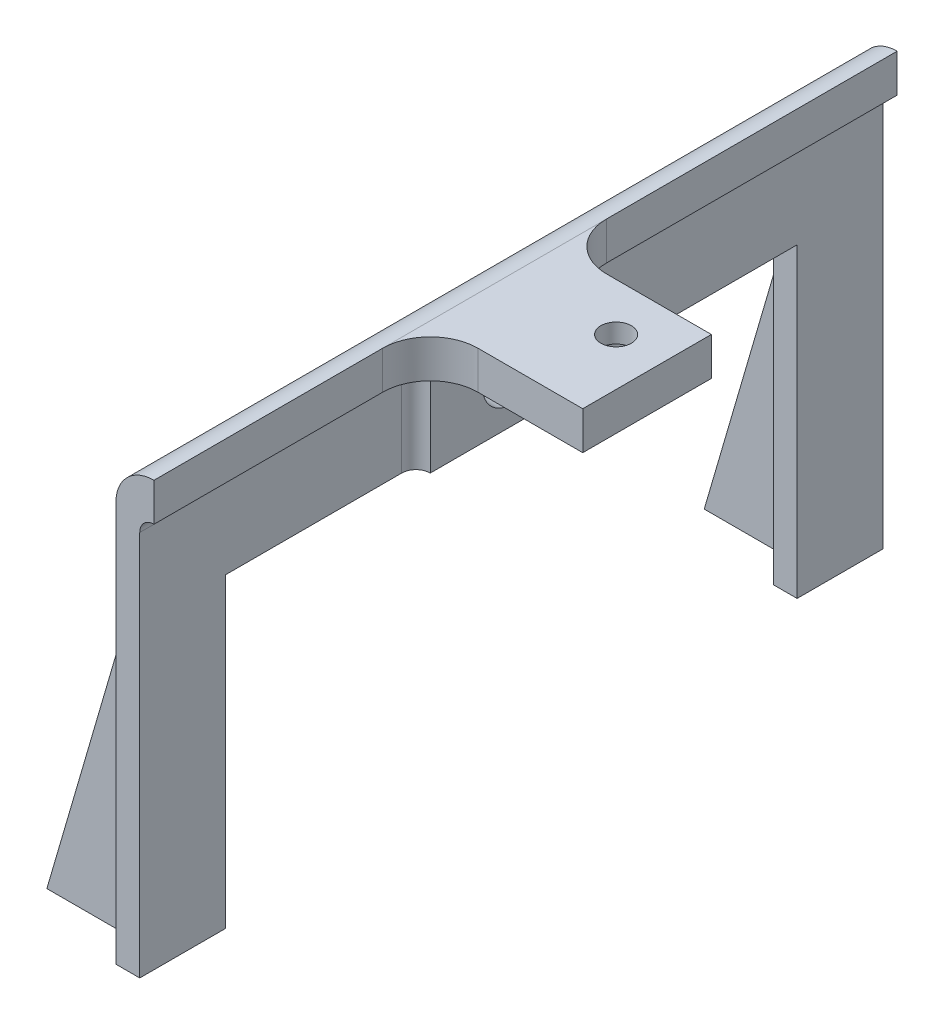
ISO-10303-21;
HEADER;
FILE_DESCRIPTION(('STEP AP214'),'2;1');
FILE_NAME('part.step','',(''),(''),'','','');
FILE_SCHEMA(('AUTOMOTIVE_DESIGN { 1 0 10303 214 1 1 1 1 }'));
ENDSEC;
DATA;
#1=APPLICATION_CONTEXT('core data for automotive mechanical design processes');
#2=APPLICATION_PROTOCOL_DEFINITION('international standard','automotive_design',2000,#1);
#3=PRODUCT_CONTEXT('',#1,'mechanical');
#4=PRODUCT('Part','Part','',(#3));
#5=PRODUCT_RELATED_PRODUCT_CATEGORY('part','',(#4));
#6=PRODUCT_DEFINITION_FORMATION('','',#4);
#7=PRODUCT_DEFINITION_CONTEXT('part definition',#1,'design');
#8=PRODUCT_DEFINITION('design','',#6,#7);
#9=PRODUCT_DEFINITION_SHAPE('','',#8);
#10=(LENGTH_UNIT() NAMED_UNIT(*) SI_UNIT(.MILLI.,.METRE.));
#11=(NAMED_UNIT(*) PLANE_ANGLE_UNIT() SI_UNIT($,.RADIAN.));
#12=(NAMED_UNIT(*) SI_UNIT($,.STERADIAN.) SOLID_ANGLE_UNIT());
#13=UNCERTAINTY_MEASURE_WITH_UNIT(LENGTH_MEASURE(1.E-05),#10,'distance_accuracy_value','');
#14=(GEOMETRIC_REPRESENTATION_CONTEXT(3) GLOBAL_UNCERTAINTY_ASSIGNED_CONTEXT((#13)) GLOBAL_UNIT_ASSIGNED_CONTEXT((#10,
#11,#12)) REPRESENTATION_CONTEXT('',''));
#15=CARTESIAN_POINT('',(0.,0.,0.));
#16=DIRECTION('',(0.,0.,1.));
#17=DIRECTION('',(1.,0.,0.));
#18=AXIS2_PLACEMENT_3D('',#15,#16,#17);
#19=CARTESIAN_POINT('',(-46.6998646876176,17.,34.5));
#20=DIRECTION('',(0.,-1.,0.));
#21=DIRECTION('',(0.,0.,-1.));
#22=AXIS2_PLACEMENT_3D('',#19,#20,#21);
#23=CYLINDRICAL_SURFACE('',#22,2.49999999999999);
#24=DIRECTION('',(0.,-1.,0.));
#25=VECTOR('',#24,1.);
#26=CARTESIAN_POINT('',(-44.8498646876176,17.,36.18151717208));
#27=LINE('',#26,#25);
#28=CARTESIAN_POINT('',(-44.8498646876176,15.5,36.18151717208));
#29=VERTEX_POINT('',#28);
#30=CARTESIAN_POINT('',(-44.8498646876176,5.,36.18151717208));
#31=VERTEX_POINT('',#30);
#32=EDGE_CURVE('E85',#29,#31,#27,.T.);
#33=ORIENTED_EDGE('',*,*,#32,.F.);
#34=CARTESIAN_POINT('',(-46.6998646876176,15.5,34.5));
#35=DIRECTION('',(0.,1.,0.));
#36=DIRECTION('',(0.,0.,1.));
#37=AXIS2_PLACEMENT_3D('',#34,#35,#36);
#38=CIRCLE('',#37,2.49999999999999);
#39=CARTESIAN_POINT('',(-44.8498646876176,15.5,32.81848282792));
#40=VERTEX_POINT('',#39);
#41=EDGE_CURVE('E82',#29,#40,#38,.F.);
#42=ORIENTED_EDGE('',*,*,#41,.T.);
#43=DIRECTION('',(0.,-1.,0.));
#44=VECTOR('',#43,1.);
#45=CARTESIAN_POINT('',(-44.8498646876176,17.,32.81848282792));
#46=LINE('',#45,#44);
#47=CARTESIAN_POINT('',(-44.8498646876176,5.,32.81848282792));
#48=VERTEX_POINT('',#47);
#49=EDGE_CURVE('E77',#40,#48,#46,.T.);
#50=ORIENTED_EDGE('',*,*,#49,.T.);
#51=CARTESIAN_POINT('',(-46.6998646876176,5.,34.5));
#52=DIRECTION('',(0.,-1.,0.));
#53=DIRECTION('',(0.,0.,1.));
#54=AXIS2_PLACEMENT_3D('',#51,#52,#53);
#55=CIRCLE('',#54,2.49999999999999);
#56=EDGE_CURVE('E80',#31,#48,#55,.T.);
#57=ORIENTED_EDGE('',*,*,#56,.F.);
#58=EDGE_LOOP('',(#33,#42,#50,#57));
#59=FACE_BOUND('',#58,.T.);
#60=ADVANCED_FACE('F48',(#59),#23,.T.);
#61=CARTESIAN_POINT('',(-44.8498646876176,17.,32.81848282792));
#62=DIRECTION('',(1.,0.,0.));
#63=DIRECTION('',(0.,0.,-1.));
#64=AXIS2_PLACEMENT_3D('',#61,#62,#63);
#65=PLANE('',#64);
#66=ORIENTED_EDGE('',*,*,#49,.F.);
#67=CARTESIAN_POINT('',(-44.8498646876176,15.5,32.81848282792));
#68=CARTESIAN_POINT('',(-44.8498646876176,15.530405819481,32.8184808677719));
#69=CARTESIAN_POINT('',(-44.8498646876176,15.5607949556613,32.8198584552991));
#70=CARTESIAN_POINT('',(-44.8498646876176,15.6213164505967,32.8253382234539));
#71=CARTESIAN_POINT('',(-44.8498646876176,15.6514488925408,32.8294394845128));
#72=CARTESIAN_POINT('',(-44.8498646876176,15.7408211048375,32.8457172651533));
#73=CARTESIAN_POINT('',(-44.8498646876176,15.7993821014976,32.8618686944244));
#74=CARTESIAN_POINT('',(-44.8498646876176,15.9127560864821,32.9039600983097));
#75=CARTESIAN_POINT('',(-44.8498646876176,15.9675719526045,32.9298924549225));
#76=CARTESIAN_POINT('',(-44.8498646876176,16.0722603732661,32.9903579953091));
#77=CARTESIAN_POINT('',(-44.8498646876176,16.1221290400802,33.0248978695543));
#78=CARTESIAN_POINT('',(-44.8498646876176,16.2172631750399,33.1021852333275));
#79=CARTESIAN_POINT('',(-44.8498646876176,16.2623677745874,33.1451293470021));
#80=CARTESIAN_POINT('',(-44.8498646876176,16.3459367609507,33.2370091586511));
#81=CARTESIAN_POINT('',(-44.8498646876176,16.3843991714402,33.285946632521));
#82=CARTESIAN_POINT('',(-44.8498646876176,16.4715402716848,33.4130121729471));
#83=CARTESIAN_POINT('',(-44.8498646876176,16.5162480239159,33.4938678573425));
#84=CARTESIAN_POINT('',(-44.8498646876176,16.5920930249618,33.6617403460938));
#85=CARTESIAN_POINT('',(-44.8498646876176,16.6231984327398,33.7487710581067));
#86=CARTESIAN_POINT('',(-44.8498646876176,16.6665725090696,33.9018424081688));
#87=CARTESIAN_POINT('',(-44.8498646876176,16.6816661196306,33.9671159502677));
#88=CARTESIAN_POINT('',(-44.8498646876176,16.7061706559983,34.0987247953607));
#89=CARTESIAN_POINT('',(-44.8498646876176,16.7155806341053,34.1650602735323));
#90=CARTESIAN_POINT('',(-44.8498646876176,16.7292033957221,34.2984907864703));
#91=CARTESIAN_POINT('',(-44.8498646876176,16.7333974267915,34.3655876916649));
#92=CARTESIAN_POINT('',(-44.8498646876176,16.7367609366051,34.4998905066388));
#93=CARTESIAN_POINT('',(-44.8498646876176,16.7359311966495,34.5670963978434));
#94=CARTESIAN_POINT('',(-44.8498646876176,16.7290730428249,34.7037454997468));
#95=CARTESIAN_POINT('',(-44.8498646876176,16.7228543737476,34.7731799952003));
#96=CARTESIAN_POINT('',(-44.8498646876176,16.7046200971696,34.911260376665));
#97=CARTESIAN_POINT('',(-44.8498646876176,16.6926027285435,34.9799060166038));
#98=CARTESIAN_POINT('',(-44.8498646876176,16.6470449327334,35.1830490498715));
#99=CARTESIAN_POINT('',(-44.8498646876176,16.6039646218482,35.3157836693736));
#100=CARTESIAN_POINT('',(-44.8498646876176,16.5134172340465,35.50984656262));
#101=CARTESIAN_POINT('',(-44.8498646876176,16.4767814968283,35.5762794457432));
#102=CARTESIAN_POINT('',(-44.8498646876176,16.3935866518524,35.7027606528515));
#103=CARTESIAN_POINT('',(-44.8498646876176,16.347026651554,35.7628084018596));
#104=CARTESIAN_POINT('',(-44.8498646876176,16.2435115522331,35.874389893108));
#105=CARTESIAN_POINT('',(-44.8498646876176,16.1864589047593,35.9258342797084));
#106=CARTESIAN_POINT('',(-44.8498646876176,16.0633220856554,36.0164711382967));
#107=CARTESIAN_POINT('',(-44.8498646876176,15.9972502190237,36.0556800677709));
#108=CARTESIAN_POINT('',(-44.8498646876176,15.8678953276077,36.1147909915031));
#109=CARTESIAN_POINT('',(-44.8498646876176,15.8054889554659,36.1366124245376));
#110=CARTESIAN_POINT('',(-44.8498646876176,15.6776413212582,36.1679227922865));
#111=CARTESIAN_POINT('',(-44.8498646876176,15.6122011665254,36.1774161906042));
#112=CARTESIAN_POINT('',(-44.8498646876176,15.4884404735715,36.1831218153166));
#113=CARTESIAN_POINT('',(-44.8498646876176,15.4301852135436,36.1807612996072));
#114=CARTESIAN_POINT('',(-44.8498646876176,15.343760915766,36.1697858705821));
#115=CARTESIAN_POINT('',(-44.8498646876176,15.3150788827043,36.1648779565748));
#116=CARTESIAN_POINT('',(-44.8498646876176,15.2582333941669,36.1526425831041));
#117=CARTESIAN_POINT('',(-44.8498646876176,15.2300699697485,36.1453149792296));
#118=CARTESIAN_POINT('',(-44.8498646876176,15.2022547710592,36.1368116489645));
#119=B_SPLINE_CURVE_WITH_KNOTS('',3,(#67,#68,#69,#70,#71,#72,#73,#74,#75,#76,#77,#78,#79,#80,
#81,#82,#83,#84,#85,#86,#87,#88,#89,#90,#91,#92,#93,#94,#95,#96,#97,#98,#99,#100,#101,#102,#103,
#104,#105,#106,#107,#108,#109,#110,#111,#112,#113,#114,#115,#116,#117,#118),.UNSPECIFIED.,.F.,
.F.,(4,2,2,2,2,2,2,2,2,2,2,2,2,2,2,2,2,2,2,2,2,2,2,2,2,4),(0.,0.0911537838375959,
0.18227680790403,0.363498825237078,0.544579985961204,0.725802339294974,0.911923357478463,
1.0980996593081,1.3737312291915,1.65000460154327,1.8507401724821,2.05150920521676,
2.25299797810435,2.4544554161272,2.66332914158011,2.8722663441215,3.28708205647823,
3.51395121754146,3.74084079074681,3.96995742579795,4.19876454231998,4.39594832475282,
4.59306069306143,4.76705180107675,4.85425602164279,4.94146544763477),.UNSPECIFIED.);
#120=EDGE_CURVE('E57',#40,#29,#119,.T.);
#121=ORIENTED_EDGE('',*,*,#120,.T.);
#122=ORIENTED_EDGE('',*,*,#32,.T.);
#123=DIRECTION('',(0.,0.,1.));
#124=VECTOR('',#123,1.);
#125=CARTESIAN_POINT('',(-44.8498646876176,5.,32.81848282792));
#126=LINE('',#125,#124);
#127=EDGE_CURVE('E86',#48,#31,#126,.T.);
#128=ORIENTED_EDGE('',*,*,#127,.F.);
#129=EDGE_LOOP('',(#66,#121,#122,#128));
#130=FACE_BOUND('',#129,.T.);
#131=ADVANCED_FACE('F92',(#130),#65,.T.);
#132=CARTESIAN_POINT('',(-46.6998646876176,17.,34.5));
#133=DIRECTION('',(0.,1.,0.));
#134=DIRECTION('',(0.,0.,1.));
#135=AXIS2_PLACEMENT_3D('',#132,#133,#134);
#136=PLANE('',#135);
#137=CARTESIAN_POINT('',(-46.6998646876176,17.,34.5));
#138=DIRECTION('',(0.,-1.,0.));
#139=DIRECTION('',(0.,0.,-1.));
#140=AXIS2_PLACEMENT_3D('',#137,#138,#139);
#141=CIRCLE('',#140,0.899999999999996);
#142=CARTESIAN_POINT('',(-46.6998646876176,17.,33.6));
#143=VERTEX_POINT('',#142);
#144=EDGE_CURVE('E90',#143,#143,#141,.T.);
#145=ORIENTED_EDGE('',*,*,#144,.T.);
#146=EDGE_LOOP('',(#145));
#147=FACE_BOUND('',#146,.T.);
#148=CARTESIAN_POINT('',(-46.6998646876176,17.,34.5));
#149=DIRECTION('',(0.,1.,0.));
#150=DIRECTION('',(0.,0.,1.));
#151=AXIS2_PLACEMENT_3D('',#148,#149,#150);
#152=CIRCLE('',#151,0.999999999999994);
#153=CARTESIAN_POINT('',(-45.9598646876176,17.,35.172606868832));
#154=VERTEX_POINT('',#153);
#155=EDGE_CURVE('E12',#154,#154,#152,.T.);
#156=ORIENTED_EDGE('',*,*,#155,.T.);
#157=EDGE_LOOP('',(#156));
#158=FACE_BOUND('',#157,.T.);
#159=ADVANCED_FACE('F104',(#147,#158),#136,.T.);
#160=CARTESIAN_POINT('',(-46.6998646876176,5.,34.5));
#161=DIRECTION('',(0.,1.,0.));
#162=DIRECTION('',(0.,0.,1.));
#163=AXIS2_PLACEMENT_3D('',#160,#161,#162);
#164=PLANE('',#163);
#165=CARTESIAN_POINT('',(-46.6998646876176,5.,34.5));
#166=DIRECTION('',(0.,-1.,0.));
#167=DIRECTION('',(0.,0.,-1.));
#168=AXIS2_PLACEMENT_3D('',#165,#166,#167);
#169=CIRCLE('',#168,0.899999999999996);
#170=CARTESIAN_POINT('',(-46.6998646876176,5.,33.6));
#171=VERTEX_POINT('',#170);
#172=EDGE_CURVE('E157',#171,#171,#169,.T.);
#173=ORIENTED_EDGE('',*,*,#172,.F.);
#174=EDGE_LOOP('',(#173));
#175=FACE_BOUND('',#174,.T.);
#176=ORIENTED_EDGE('',*,*,#56,.T.);
#177=ORIENTED_EDGE('',*,*,#127,.T.);
#178=EDGE_LOOP('',(#176,#177));
#179=FACE_BOUND('',#178,.T.);
#180=ADVANCED_FACE('F89',(#175,#179),#164,.F.);
#181=CARTESIAN_POINT('',(-46.6998646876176,15.5,34.5));
#182=DIRECTION('',(0.,1.,0.));
#183=DIRECTION('',(0.,0.,1.));
#184=AXIS2_PLACEMENT_3D('',#181,#182,#183);
#185=DEGENERATE_TOROIDAL_SURFACE('',#184,0.999999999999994,1.5,.T.);
#186=ORIENTED_EDGE('',*,*,#155,.F.);
#187=EDGE_LOOP('',(#186));
#188=FACE_BOUND('',#187,.T.);
#189=ORIENTED_EDGE('',*,*,#120,.F.);
#190=ORIENTED_EDGE('',*,*,#41,.F.);
#191=EDGE_LOOP('',(#189,#190));
#192=FACE_BOUND('',#191,.T.);
#193=ADVANCED_FACE('F50',(#188,#192),#185,.T.);
#194=CARTESIAN_POINT('',(-46.6998646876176,17.,34.5));
#195=DIRECTION('',(0.,-1.,0.));
#196=DIRECTION('',(0.,0.,-1.));
#197=AXIS2_PLACEMENT_3D('',#194,#195,#196);
#198=CYLINDRICAL_SURFACE('',#197,0.899999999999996);
#199=ORIENTED_EDGE('',*,*,#144,.F.);
#200=EDGE_LOOP('',(#199));
#201=FACE_BOUND('',#200,.T.);
#202=ORIENTED_EDGE('',*,*,#172,.T.);
#203=EDGE_LOOP('',(#202));
#204=FACE_BOUND('',#203,.T.);
#205=ADVANCED_FACE('F132',(#201,#204),#198,.F.);
#206=CLOSED_SHELL('',(#60,#131,#159,#180,#193,#205));
#207=MANIFOLD_SOLID_BREP('B2',#206);
#208=CARTESIAN_POINT('',(-46.6998646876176,17.,-34.5));
#209=DIRECTION('',(0.,-1.,0.));
#210=DIRECTION('',(0.,0.,-1.));
#211=AXIS2_PLACEMENT_3D('',#208,#209,#210);
#212=CYLINDRICAL_SURFACE('',#211,2.49999999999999);
#213=DIRECTION('',(0.,-1.,0.));
#214=VECTOR('',#213,1.);
#215=CARTESIAN_POINT('',(-44.8498646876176,17.,-32.81848282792));
#216=LINE('',#215,#214);
#217=CARTESIAN_POINT('',(-44.8498646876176,15.5,-32.81848282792));
#218=VERTEX_POINT('',#217);
#219=CARTESIAN_POINT('',(-44.8498646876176,5.,-32.81848282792));
#220=VERTEX_POINT('',#219);
#221=EDGE_CURVE('E211',#218,#220,#216,.T.);
#222=ORIENTED_EDGE('',*,*,#221,.F.);
#223=CARTESIAN_POINT('',(-46.6998646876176,15.5,-34.5));
#224=DIRECTION('',(0.,-1.,0.));
#225=DIRECTION('',(0.,0.,-1.));
#226=AXIS2_PLACEMENT_3D('',#223,#224,#225);
#227=CIRCLE('',#226,2.49999999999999);
#228=CARTESIAN_POINT('',(-44.8498646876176,15.5,-36.18151717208));
#229=VERTEX_POINT('',#228);
#230=EDGE_CURVE('E208',#218,#229,#227,.T.);
#231=ORIENTED_EDGE('',*,*,#230,.T.);
#232=DIRECTION('',(0.,-1.,0.));
#233=VECTOR('',#232,1.);
#234=CARTESIAN_POINT('',(-44.8498646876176,17.,-36.18151717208));
#235=LINE('',#234,#233);
#236=CARTESIAN_POINT('',(-44.8498646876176,5.,-36.18151717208));
#237=VERTEX_POINT('',#236);
#238=EDGE_CURVE('E203',#229,#237,#235,.T.);
#239=ORIENTED_EDGE('',*,*,#238,.T.);
#240=CARTESIAN_POINT('',(-46.6998646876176,5.,-34.5));
#241=DIRECTION('',(0.,-1.,0.));
#242=DIRECTION('',(0.,0.,-1.));
#243=AXIS2_PLACEMENT_3D('',#240,#241,#242);
#244=CIRCLE('',#243,2.49999999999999);
#245=EDGE_CURVE('E206',#220,#237,#244,.T.);
#246=ORIENTED_EDGE('',*,*,#245,.F.);
#247=EDGE_LOOP('',(#222,#231,#239,#246));
#248=FACE_BOUND('',#247,.T.);
#249=ADVANCED_FACE('F174',(#248),#212,.T.);
#250=CARTESIAN_POINT('',(-44.8498646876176,17.,-36.18151717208));
#251=DIRECTION('',(1.,0.,0.));
#252=DIRECTION('',(0.,0.,-1.));
#253=AXIS2_PLACEMENT_3D('',#250,#251,#252);
#254=PLANE('',#253);
#255=ORIENTED_EDGE('',*,*,#238,.F.);
#256=CARTESIAN_POINT('',(-44.8498646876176,15.5,-36.18151717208));
#257=CARTESIAN_POINT('',(-44.8498646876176,15.530405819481,-36.1815191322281));
#258=CARTESIAN_POINT('',(-44.8498646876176,15.5607949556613,-36.1801415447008));
#259=CARTESIAN_POINT('',(-44.8498646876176,15.6213164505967,-36.1746617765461));
#260=CARTESIAN_POINT('',(-44.8498646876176,15.6514488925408,-36.1705605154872));
#261=CARTESIAN_POINT('',(-44.8498646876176,15.7408211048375,-36.1542827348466));
#262=CARTESIAN_POINT('',(-44.8498646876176,15.7993821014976,-36.1381313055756));
#263=CARTESIAN_POINT('',(-44.8498646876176,15.9127560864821,-36.0960399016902));
#264=CARTESIAN_POINT('',(-44.8498646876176,15.9675719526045,-36.0701075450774));
#265=CARTESIAN_POINT('',(-44.8498646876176,16.0722603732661,-36.0096420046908));
#266=CARTESIAN_POINT('',(-44.8498646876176,16.1221290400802,-35.9751021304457));
#267=CARTESIAN_POINT('',(-44.8498646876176,16.2172631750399,-35.8978147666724));
#268=CARTESIAN_POINT('',(-44.8498646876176,16.2623677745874,-35.8548706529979));
#269=CARTESIAN_POINT('',(-44.8498646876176,16.3459367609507,-35.7629908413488));
#270=CARTESIAN_POINT('',(-44.8498646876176,16.3843991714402,-35.714053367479));
#271=CARTESIAN_POINT('',(-44.8498646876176,16.4715402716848,-35.5869878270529));
#272=CARTESIAN_POINT('',(-44.8498646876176,16.5162480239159,-35.5061321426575));
#273=CARTESIAN_POINT('',(-44.8498646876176,16.5920930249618,-35.3382596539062));
#274=CARTESIAN_POINT('',(-44.8498646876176,16.6231984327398,-35.2512289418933));
#275=CARTESIAN_POINT('',(-44.8498646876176,16.6665725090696,-35.0981575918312));
#276=CARTESIAN_POINT('',(-44.8498646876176,16.6816661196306,-35.0328840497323));
#277=CARTESIAN_POINT('',(-44.8498646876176,16.7061706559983,-34.9012752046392));
#278=CARTESIAN_POINT('',(-44.8498646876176,16.7155806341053,-34.8349397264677));
#279=CARTESIAN_POINT('',(-44.8498646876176,16.7292033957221,-34.7015092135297));
#280=CARTESIAN_POINT('',(-44.8498646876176,16.7333974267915,-34.6344123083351));
#281=CARTESIAN_POINT('',(-44.8498646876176,16.7367609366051,-34.5001094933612));
#282=CARTESIAN_POINT('',(-44.8498646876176,16.7359311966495,-34.4329036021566));
#283=CARTESIAN_POINT('',(-44.8498646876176,16.7290730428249,-34.2962545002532));
#284=CARTESIAN_POINT('',(-44.8498646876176,16.7228543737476,-34.2268200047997));
#285=CARTESIAN_POINT('',(-44.8498646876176,16.7046200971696,-34.0887396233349));
#286=CARTESIAN_POINT('',(-44.8498646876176,16.6926027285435,-34.0200939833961));
#287=CARTESIAN_POINT('',(-44.8498646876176,16.6470449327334,-33.8169509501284));
#288=CARTESIAN_POINT('',(-44.8498646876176,16.6039646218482,-33.6842163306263));
#289=CARTESIAN_POINT('',(-44.8498646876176,16.5134172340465,-33.49015343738));
#290=CARTESIAN_POINT('',(-44.8498646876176,16.4767814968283,-33.4237205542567));
#291=CARTESIAN_POINT('',(-44.8498646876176,16.3935866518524,-33.2972393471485));
#292=CARTESIAN_POINT('',(-44.8498646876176,16.347026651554,-33.2371915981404));
#293=CARTESIAN_POINT('',(-44.8498646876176,16.2435115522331,-33.1256101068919));
#294=CARTESIAN_POINT('',(-44.8498646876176,16.1864589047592,-33.0741657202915));
#295=CARTESIAN_POINT('',(-44.8498646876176,16.0633220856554,-32.9835288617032));
#296=CARTESIAN_POINT('',(-44.8498646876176,15.9972502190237,-32.9443199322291));
#297=CARTESIAN_POINT('',(-44.8498646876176,15.8678953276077,-32.8852090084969));
#298=CARTESIAN_POINT('',(-44.8498646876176,15.8054889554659,-32.8633875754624));
#299=CARTESIAN_POINT('',(-44.8498646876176,15.6776413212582,-32.8320772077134));
#300=CARTESIAN_POINT('',(-44.8498646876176,15.6122011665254,-32.8225838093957));
#301=CARTESIAN_POINT('',(-44.8498646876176,15.4884404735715,-32.8168781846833));
#302=CARTESIAN_POINT('',(-44.8498646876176,15.4301852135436,-32.8192387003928));
#303=CARTESIAN_POINT('',(-44.8498646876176,15.343760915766,-32.8302141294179));
#304=CARTESIAN_POINT('',(-44.8498646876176,15.3150788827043,-32.8351220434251));
#305=CARTESIAN_POINT('',(-44.8498646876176,15.2582333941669,-32.8473574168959));
#306=CARTESIAN_POINT('',(-44.8498646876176,15.2300699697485,-32.8546850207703));
#307=CARTESIAN_POINT('',(-44.8498646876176,15.2022547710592,-32.8631883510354));
#308=B_SPLINE_CURVE_WITH_KNOTS('',3,(#256,#257,#258,#259,#260,#261,#262,#263,#264,#265,#266,
#267,#268,#269,#270,#271,#272,#273,#274,#275,#276,#277,#278,#279,#280,#281,#282,#283,#284,#285,
#286,#287,#288,#289,#290,#291,#292,#293,#294,#295,#296,#297,#298,#299,#300,#301,#302,#303,#304,
#305,#306,#307),.UNSPECIFIED.,.F.,.F.,(4,2,2,2,2,2,2,2,2,2,2,2,2,2,2,2,2,2,2,2,2,2,2,2,2,4),(0.,
0.0911537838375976,0.18227680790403,0.363498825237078,0.544579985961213,0.725802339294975,
0.911923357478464,1.0980996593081,1.37373122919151,1.65000460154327,1.8507401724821,
2.05150920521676,2.25299797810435,2.4544554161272,2.66332914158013,2.87226634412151,
3.28708205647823,3.51395121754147,3.74084079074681,3.96995742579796,4.19876454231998,
4.39594832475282,4.59306069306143,4.76705180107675,4.85425602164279,4.94146544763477),.UNSPECIFIED.);
#309=EDGE_CURVE('E183',#229,#218,#308,.T.);
#310=ORIENTED_EDGE('',*,*,#309,.T.);
#311=ORIENTED_EDGE('',*,*,#221,.T.);
#312=DIRECTION('',(0.,0.,1.));
#313=VECTOR('',#312,1.);
#314=CARTESIAN_POINT('',(-44.8498646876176,5.,-36.18151717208));
#315=LINE('',#314,#313);
#316=EDGE_CURVE('E212',#237,#220,#315,.T.);
#317=ORIENTED_EDGE('',*,*,#316,.F.);
#318=EDGE_LOOP('',(#255,#310,#311,#317));
#319=FACE_BOUND('',#318,.T.);
#320=ADVANCED_FACE('F218',(#319),#254,.T.);
#321=CARTESIAN_POINT('',(-46.6998646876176,17.,-34.5));
#322=DIRECTION('',(0.,-1.,0.));
#323=DIRECTION('',(0.,0.,-1.));
#324=AXIS2_PLACEMENT_3D('',#321,#322,#323);
#325=PLANE('',#324);
#326=CARTESIAN_POINT('',(-46.6998646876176,17.,-34.5));
#327=DIRECTION('',(0.,-1.,0.));
#328=DIRECTION('',(0.,0.,-1.));
#329=AXIS2_PLACEMENT_3D('',#326,#327,#328);
#330=CIRCLE('',#329,0.899999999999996);
#331=CARTESIAN_POINT('',(-46.6998646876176,17.,-35.4));
#332=VERTEX_POINT('',#331);
#333=EDGE_CURVE('E216',#332,#332,#330,.T.);
#334=ORIENTED_EDGE('',*,*,#333,.T.);
#335=EDGE_LOOP('',(#334));
#336=FACE_BOUND('',#335,.T.);
#337=CARTESIAN_POINT('',(-46.6998646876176,17.,-34.5));
#338=DIRECTION('',(0.,-1.,0.));
#339=DIRECTION('',(0.,0.,-1.));
#340=AXIS2_PLACEMENT_3D('',#337,#338,#339);
#341=CIRCLE('',#340,0.999999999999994);
#342=CARTESIAN_POINT('',(-45.9598646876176,17.,-33.827393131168));
#343=VERTEX_POINT('',#342);
#344=EDGE_CURVE('E46',#343,#343,#341,.F.);
#345=ORIENTED_EDGE('',*,*,#344,.T.);
#346=EDGE_LOOP('',(#345));
#347=FACE_BOUND('',#346,.T.);
#348=ADVANCED_FACE('F230',(#336,#347),#325,.F.);
#349=CARTESIAN_POINT('',(-46.6998646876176,5.,-34.5));
#350=DIRECTION('',(0.,-1.,0.));
#351=DIRECTION('',(0.,0.,-1.));
#352=AXIS2_PLACEMENT_3D('',#349,#350,#351);
#353=PLANE('',#352);
#354=CARTESIAN_POINT('',(-46.6998646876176,5.,-34.5));
#355=DIRECTION('',(0.,-1.,0.));
#356=DIRECTION('',(0.,0.,-1.));
#357=AXIS2_PLACEMENT_3D('',#354,#355,#356);
#358=CIRCLE('',#357,0.899999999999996);
#359=CARTESIAN_POINT('',(-46.6998646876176,5.,-35.4));
#360=VERTEX_POINT('',#359);
#361=EDGE_CURVE('E283',#360,#360,#358,.T.);
#362=ORIENTED_EDGE('',*,*,#361,.F.);
#363=EDGE_LOOP('',(#362));
#364=FACE_BOUND('',#363,.T.);
#365=ORIENTED_EDGE('',*,*,#245,.T.);
#366=ORIENTED_EDGE('',*,*,#316,.T.);
#367=EDGE_LOOP('',(#365,#366));
#368=FACE_BOUND('',#367,.T.);
#369=ADVANCED_FACE('F215',(#364,#368),#353,.T.);
#370=CARTESIAN_POINT('',(-46.6998646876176,15.5,-34.5));
#371=DIRECTION('',(0.,-1.,0.));
#372=DIRECTION('',(0.,0.,-1.));
#373=AXIS2_PLACEMENT_3D('',#370,#371,#372);
#374=DEGENERATE_TOROIDAL_SURFACE('',#373,0.999999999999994,1.5,.T.);
#375=ORIENTED_EDGE('',*,*,#344,.F.);
#376=EDGE_LOOP('',(#375));
#377=FACE_BOUND('',#376,.T.);
#378=ORIENTED_EDGE('',*,*,#309,.F.);
#379=ORIENTED_EDGE('',*,*,#230,.F.);
#380=EDGE_LOOP('',(#378,#379));
#381=FACE_BOUND('',#380,.T.);
#382=ADVANCED_FACE('F176',(#377,#381),#374,.T.);
#383=CARTESIAN_POINT('',(-46.6998646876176,17.,-34.5));
#384=DIRECTION('',(0.,-1.,0.));
#385=DIRECTION('',(0.,0.,-1.));
#386=AXIS2_PLACEMENT_3D('',#383,#384,#385);
#387=CYLINDRICAL_SURFACE('',#386,0.899999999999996);
#388=ORIENTED_EDGE('',*,*,#333,.F.);
#389=EDGE_LOOP('',(#388));
#390=FACE_BOUND('',#389,.T.);
#391=ORIENTED_EDGE('',*,*,#361,.T.);
#392=EDGE_LOOP('',(#391));
#393=FACE_BOUND('',#392,.T.);
#394=ADVANCED_FACE('F258',(#390,#393),#387,.F.);
#395=CLOSED_SHELL('',(#249,#320,#348,#369,#382,#394));
#396=MANIFOLD_SOLID_BREP('B6',#395);
#397=CARTESIAN_POINT('',(-37.6998646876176,47.,15.));
#398=DIRECTION('',(0.,1.,0.));
#399=DIRECTION('',(0.,0.,1.));
#400=AXIS2_PLACEMENT_3D('',#397,#398,#399);
#401=PLANE('',#400);
#402=CARTESIAN_POINT('',(-31.6998646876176,47.,1.5));
#403=DIRECTION('',(0.,-1.,0.));
#404=DIRECTION('',(0.,0.,-1.));
#405=AXIS2_PLACEMENT_3D('',#402,#403,#404);
#406=CIRCLE('',#405,3.);
#407=CARTESIAN_POINT('',(-31.6998646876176,47.,-1.5));
#408=VERTEX_POINT('',#407);
#409=EDGE_CURVE('E524',#408,#408,#406,.T.);
#410=ORIENTED_EDGE('',*,*,#409,.F.);
#411=EDGE_LOOP('',(#410));
#412=FACE_BOUND('',#411,.T.);
#413=CARTESIAN_POINT('',(-37.6998646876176,47.,15.));
#414=DIRECTION('',(0.,-1.,0.));
#415=DIRECTION('',(0.,0.,1.));
#416=AXIS2_PLACEMENT_3D('',#413,#414,#415);
#417=CIRCLE('',#416,5.);
#418=CARTESIAN_POINT('',(-41.1998646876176,47.,11.4292857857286));
#419=VERTEX_POINT('',#418);
#420=CARTESIAN_POINT('',(-37.6998646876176,47.,10.));
#421=VERTEX_POINT('',#420);
#422=EDGE_CURVE('E600',#419,#421,#417,.T.);
#423=ORIENTED_EDGE('',*,*,#422,.F.);
#424=DIRECTION('',(0.,0.,1.));
#425=VECTOR('',#424,1.);
#426=CARTESIAN_POINT('',(-41.1998646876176,47.,-3.5));
#427=LINE('',#426,#425);
#428=CARTESIAN_POINT('',(-41.1998646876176,47.,-4.92928578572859));
#429=VERTEX_POINT('',#428);
#430=EDGE_CURVE('E684',#419,#429,#427,.F.);
#431=ORIENTED_EDGE('',*,*,#430,.T.);
#432=CARTESIAN_POINT('',(-37.6998646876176,47.,-8.5));
#433=DIRECTION('',(0.,-1.,0.));
#434=DIRECTION('',(0.,0.,1.));
#435=AXIS2_PLACEMENT_3D('',#432,#433,#434);
#436=CIRCLE('',#435,5.);
#437=CARTESIAN_POINT('',(-37.6998646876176,47.,-3.49999999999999));
#438=VERTEX_POINT('',#437);
#439=EDGE_CURVE('E610',#438,#429,#436,.T.);
#440=ORIENTED_EDGE('',*,*,#439,.F.);
#441=DIRECTION('',(-1.,0.,0.));
#442=VECTOR('',#441,1.);
#443=CARTESIAN_POINT('',(-37.6998646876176,47.,-3.5));
#444=LINE('',#443,#442);
#445=CARTESIAN_POINT('',(-26.6998646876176,47.,-3.5));
#446=VERTEX_POINT('',#445);
#447=EDGE_CURVE('E607',#446,#438,#444,.T.);
#448=ORIENTED_EDGE('',*,*,#447,.F.);
#449=DIRECTION('',(0.,0.,-1.));
#450=VECTOR('',#449,1.);
#451=CARTESIAN_POINT('',(-26.6998646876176,47.,-3.5));
#452=LINE('',#451,#450);
#453=CARTESIAN_POINT('',(-26.6998646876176,47.,10.));
#454=VERTEX_POINT('',#453);
#455=EDGE_CURVE('E605',#454,#446,#452,.T.);
#456=ORIENTED_EDGE('',*,*,#455,.F.);
#457=DIRECTION('',(1.,0.,0.));
#458=VECTOR('',#457,1.);
#459=CARTESIAN_POINT('',(-26.6998646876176,47.,10.));
#460=LINE('',#459,#458);
#461=EDGE_CURVE('E603',#421,#454,#460,.T.);
#462=ORIENTED_EDGE('',*,*,#461,.F.);
#463=EDGE_LOOP('',(#423,#431,#440,#448,#456,#462));
#464=FACE_BOUND('',#463,.T.);
#465=ADVANCED_FACE('F291',(#412,#464),#401,.F.);
#466=DIRECTION('',(-1.,0.,0.));
#467=VECTOR('',#466,1.);
#468=CARTESIAN_POINT('',(-44.1998646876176,47.,-5.));
#469=LINE('',#468,#467);
#470=CARTESIAN_POINT('',(-41.270578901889,47.,-5.));
#471=VERTEX_POINT('',#470);
#472=CARTESIAN_POINT('',(-42.6998646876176,47.,-5.));
#473=VERTEX_POINT('',#472);
#474=EDGE_CURVE('E680',#471,#473,#469,.T.);
#475=ORIENTED_EDGE('',*,*,#474,.T.);
#476=DIRECTION('',(0.,0.,-1.));
#477=VECTOR('',#476,1.);
#478=CARTESIAN_POINT('',(-42.6998646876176,47.,-39.));
#479=LINE('',#478,#477);
#480=CARTESIAN_POINT('',(-42.6998646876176,47.,-8.5));
#481=VERTEX_POINT('',#480);
#482=EDGE_CURVE('E682',#473,#481,#479,.T.);
#483=ORIENTED_EDGE('',*,*,#482,.T.);
#484=EDGE_CURVE('E609',#471,#481,#436,.T.);
#485=ORIENTED_EDGE('',*,*,#484,.F.);
#486=EDGE_LOOP('',(#475,#483,#485));
#487=FACE_BOUND('',#486,.T.);
#488=ADVANCED_FACE('F831',(#487),#401,.F.);
#489=CARTESIAN_POINT('',(-46.6998646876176,47.,39.));
#490=DIRECTION('',(1.,0.,0.));
#491=DIRECTION('',(0.,0.,-1.));
#492=AXIS2_PLACEMENT_3D('',#489,#490,#491);
#493=PLANE('',#492);
#494=CARTESIAN_POINT('',(-46.6998646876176,42.15,1.50000000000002));
#495=DIRECTION('',(-1.,0.,0.));
#496=DIRECTION('',(0.,0.,1.));
#497=AXIS2_PLACEMENT_3D('',#494,#495,#496);
#498=CIRCLE('',#497,1.59999999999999);
#499=CARTESIAN_POINT('',(-46.6998646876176,42.15,3.10000000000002));
#500=VERTEX_POINT('',#499);
#501=EDGE_CURVE('E538',#500,#500,#498,.T.);
#502=ORIENTED_EDGE('',*,*,#501,.F.);
#503=EDGE_LOOP('',(#502));
#504=FACE_BOUND('',#503,.T.);
#505=DIRECTION('',(0.,-1.,0.));
#506=VECTOR('',#505,1.);
#507=CARTESIAN_POINT('',(-46.6998646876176,41.,33.25));
#508=LINE('',#507,#506);
#509=CARTESIAN_POINT('',(-46.6998646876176,41.,33.25));
#510=VERTEX_POINT('',#509);
#511=CARTESIAN_POINT('',(-46.6998646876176,5.,33.25));
#512=VERTEX_POINT('',#511);
#513=EDGE_CURVE('E1295',#510,#512,#508,.T.);
#514=ORIENTED_EDGE('',*,*,#513,.F.);
#515=DIRECTION('',(0.,0.,-1.));
#516=VECTOR('',#515,1.);
#517=CARTESIAN_POINT('',(-46.6998646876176,41.,35.75));
#518=LINE('',#517,#516);
#519=CARTESIAN_POINT('',(-46.6998646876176,41.,35.75));
#520=VERTEX_POINT('',#519);
#521=EDGE_CURVE('E1303',#520,#510,#518,.T.);
#522=ORIENTED_EDGE('',*,*,#521,.F.);
#523=DIRECTION('',(0.,1.,0.));
#524=VECTOR('',#523,1.);
#525=CARTESIAN_POINT('',(-46.6998646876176,41.,35.75));
#526=LINE('',#525,#524);
#527=CARTESIAN_POINT('',(-46.6998646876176,5.00000000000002,35.75));
#528=VERTEX_POINT('',#527);
#529=EDGE_CURVE('E1313',#528,#520,#526,.T.);
#530=ORIENTED_EDGE('',*,*,#529,.F.);
#531=DIRECTION('',(0.,0.,1.));
#532=VECTOR('',#531,1.);
#533=CARTESIAN_POINT('',(-46.6998646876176,5.,39.));
#534=LINE('',#533,#532);
#535=CARTESIAN_POINT('',(-46.6998646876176,5.,39.));
#536=VERTEX_POINT('',#535);
#537=EDGE_CURVE('E644',#528,#536,#534,.T.);
#538=ORIENTED_EDGE('',*,*,#537,.T.);
#539=DIRECTION('',(0.,-1.,0.));
#540=VECTOR('',#539,1.);
#541=CARTESIAN_POINT('',(-46.6998646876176,47.,39.));
#542=LINE('',#541,#540);
#543=CARTESIAN_POINT('',(-46.6998646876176,47.,39.));
#544=VERTEX_POINT('',#543);
#545=EDGE_CURVE('E651',#544,#536,#542,.T.);
#546=ORIENTED_EDGE('',*,*,#545,.F.);
#547=DIRECTION('',(0.,0.,1.));
#548=VECTOR('',#547,1.);
#549=CARTESIAN_POINT('',(-46.6998646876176,47.,-39.));
#550=LINE('',#549,#548);
#551=CARTESIAN_POINT('',(-46.6998646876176,47.,-39.));
#552=VERTEX_POINT('',#551);
#553=EDGE_CURVE('E669',#544,#552,#550,.F.);
#554=ORIENTED_EDGE('',*,*,#553,.T.);
#555=DIRECTION('',(0.,-1.,0.));
#556=VECTOR('',#555,1.);
#557=CARTESIAN_POINT('',(-46.6998646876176,51.,-39.));
#558=LINE('',#557,#556);
#559=CARTESIAN_POINT('',(-46.6998646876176,5.,-39.));
#560=VERTEX_POINT('',#559);
#561=EDGE_CURVE('E598',#552,#560,#558,.T.);
#562=ORIENTED_EDGE('',*,*,#561,.T.);
#563=DIRECTION('',(0.,0.,1.));
#564=VECTOR('',#563,1.);
#565=CARTESIAN_POINT('',(-46.6998646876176,5.,-39.));
#566=LINE('',#565,#564);
#567=CARTESIAN_POINT('',(-46.6998646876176,5.,-35.75));
#568=VERTEX_POINT('',#567);
#569=EDGE_CURVE('E514',#560,#568,#566,.T.);
#570=ORIENTED_EDGE('',*,*,#569,.T.);
#571=DIRECTION('',(0.,-1.,0.));
#572=VECTOR('',#571,1.);
#573=CARTESIAN_POINT('',(-46.6998646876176,41.,-35.75));
#574=LINE('',#573,#572);
#575=CARTESIAN_POINT('',(-46.6998646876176,41.,-35.75));
#576=VERTEX_POINT('',#575);
#577=EDGE_CURVE('E500',#576,#568,#574,.T.);
#578=ORIENTED_EDGE('',*,*,#577,.F.);
#579=DIRECTION('',(0.,0.,-1.));
#580=VECTOR('',#579,1.);
#581=CARTESIAN_POINT('',(-46.6998646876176,41.,-35.75));
#582=LINE('',#581,#580);
#583=CARTESIAN_POINT('',(-46.6998646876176,41.,-33.25));
#584=VERTEX_POINT('',#583);
#585=EDGE_CURVE('E489',#584,#576,#582,.T.);
#586=ORIENTED_EDGE('',*,*,#585,.F.);
#587=DIRECTION('',(0.,1.,0.));
#588=VECTOR('',#587,1.);
#589=CARTESIAN_POINT('',(-46.6998646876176,41.,-33.25));
#590=LINE('',#589,#588);
#591=CARTESIAN_POINT('',(-46.6998646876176,5.,-33.25));
#592=VERTEX_POINT('',#591);
#593=EDGE_CURVE('E501',#592,#584,#590,.T.);
#594=ORIENTED_EDGE('',*,*,#593,.F.);
#595=CARTESIAN_POINT('',(-46.6998646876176,5.,-30.));
#596=VERTEX_POINT('',#595);
#597=EDGE_CURVE('E564',#592,#596,#566,.T.);
#598=ORIENTED_EDGE('',*,*,#597,.T.);
#599=DIRECTION('',(0.,-1.,0.));
#600=VECTOR('',#599,1.);
#601=CARTESIAN_POINT('',(-46.6998646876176,47.,-30.));
#602=LINE('',#601,#600);
#603=CARTESIAN_POINT('',(-46.6998646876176,37.15,-30.));
#604=VERTEX_POINT('',#603);
#605=EDGE_CURVE('E571',#604,#596,#602,.T.);
#606=ORIENTED_EDGE('',*,*,#605,.F.);
#607=DIRECTION('',(0.,0.,-1.));
#608=VECTOR('',#607,1.);
#609=CARTESIAN_POINT('',(-46.6998646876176,37.15,-30.));
#610=LINE('',#609,#608);
#611=CARTESIAN_POINT('',(-46.6998646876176,37.15,30.));
#612=VERTEX_POINT('',#611);
#613=EDGE_CURVE('E548',#612,#604,#610,.T.);
#614=ORIENTED_EDGE('',*,*,#613,.F.);
#615=DIRECTION('',(0.,-1.,0.));
#616=VECTOR('',#615,1.);
#617=CARTESIAN_POINT('',(-46.6998646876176,47.,30.));
#618=LINE('',#617,#616);
#619=CARTESIAN_POINT('',(-46.6998646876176,5.,30.));
#620=VERTEX_POINT('',#619);
#621=EDGE_CURVE('E653',#612,#620,#618,.T.);
#622=ORIENTED_EDGE('',*,*,#621,.T.);
#623=EDGE_CURVE('E645',#620,#512,#534,.T.);
#624=ORIENTED_EDGE('',*,*,#623,.T.);
#625=EDGE_LOOP('',(#514,#522,#530,#538,#546,#554,#562,#570,#578,#586,#594,#598,#606,#614,#622,#624));
#626=FACE_BOUND('',#625,.T.);
#627=ADVANCED_FACE('F512',(#504,#626),#493,.F.);
#628=CARTESIAN_POINT('',(-31.6998646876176,51.,1.5));
#629=DIRECTION('',(0.,-1.,0.));
#630=DIRECTION('',(0.,0.,-1.));
#631=AXIS2_PLACEMENT_3D('',#628,#629,#630);
#632=CYLINDRICAL_SURFACE('',#631,1.6);
#633=CARTESIAN_POINT('',(-31.6998646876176,51.,1.5));
#634=DIRECTION('',(0.,1.,0.));
#635=DIRECTION('',(0.,0.,1.));
#636=AXIS2_PLACEMENT_3D('',#633,#634,#635);
#637=CIRCLE('',#636,1.6);
#638=CARTESIAN_POINT('',(-31.6998646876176,51.,3.1));
#639=VERTEX_POINT('',#638);
#640=EDGE_CURVE('E576',#639,#639,#637,.T.);
#641=ORIENTED_EDGE('',*,*,#640,.T.);
#642=EDGE_LOOP('',(#641));
#643=FACE_BOUND('',#642,.T.);
#644=CARTESIAN_POINT('',(-31.6998646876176,49.,1.5));
#645=DIRECTION('',(0.,-1.,0.));
#646=DIRECTION('',(0.,0.,-1.));
#647=AXIS2_PLACEMENT_3D('',#644,#645,#646);
#648=CIRCLE('',#647,1.6);
#649=CARTESIAN_POINT('',(-31.6998646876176,49.,-0.1));
#650=VERTEX_POINT('',#649);
#651=EDGE_CURVE('E528',#650,#650,#648,.T.);
#652=ORIENTED_EDGE('',*,*,#651,.T.);
#653=EDGE_LOOP('',(#652));
#654=FACE_BOUND('',#653,.T.);
#655=ADVANCED_FACE('F851',(#643,#654),#632,.F.);
#656=CARTESIAN_POINT('',(-42.6998646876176,42.15,1.50000000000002));
#657=DIRECTION('',(-1.,0.,0.));
#658=DIRECTION('',(0.,0.,1.));
#659=AXIS2_PLACEMENT_3D('',#656,#657,#658);
#660=CYLINDRICAL_SURFACE('',#659,1.59999999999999);
#661=ORIENTED_EDGE('',*,*,#501,.T.);
#662=EDGE_LOOP('',(#661));
#663=FACE_BOUND('',#662,.T.);
#664=CARTESIAN_POINT('',(-44.6998646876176,42.15,1.50000000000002));
#665=DIRECTION('',(1.,0.,0.));
#666=DIRECTION('',(0.,0.,-1.));
#667=AXIS2_PLACEMENT_3D('',#664,#665,#666);
#668=CIRCLE('',#667,1.59999999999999);
#669=CARTESIAN_POINT('',(-44.6998646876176,42.15,-0.0999999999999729));
#670=VERTEX_POINT('',#669);
#671=EDGE_CURVE('E534',#670,#670,#668,.F.);
#672=ORIENTED_EDGE('',*,*,#671,.F.);
#673=EDGE_LOOP('',(#672));
#674=FACE_BOUND('',#673,.T.);
#675=ADVANCED_FACE('F844',(#663,#674),#660,.F.);
#676=CARTESIAN_POINT('',(-42.6998646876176,47.,15.));
#677=VERTEX_POINT('',#676);
#678=CARTESIAN_POINT('',(-41.270578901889,47.,11.5));
#679=VERTEX_POINT('',#678);
#680=EDGE_CURVE('E601',#677,#679,#417,.T.);
#681=ORIENTED_EDGE('',*,*,#680,.F.);
#682=DIRECTION('',(0.,0.,-1.));
#683=VECTOR('',#682,1.);
#684=CARTESIAN_POINT('',(-42.6998646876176,47.,10.));
#685=LINE('',#684,#683);
#686=CARTESIAN_POINT('',(-42.6998646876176,47.,11.5));
#687=VERTEX_POINT('',#686);
#688=EDGE_CURVE('E678',#677,#687,#685,.T.);
#689=ORIENTED_EDGE('',*,*,#688,.T.);
#690=DIRECTION('',(-1.,0.,0.));
#691=VECTOR('',#690,1.);
#692=CARTESIAN_POINT('',(-42.6998646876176,47.,11.5));
#693=LINE('',#692,#691);
#694=EDGE_CURVE('E676',#687,#679,#693,.F.);
#695=ORIENTED_EDGE('',*,*,#694,.T.);
#696=EDGE_LOOP('',(#681,#689,#695));
#697=FACE_BOUND('',#696,.T.);
#698=ADVANCED_FACE('F834',(#697),#401,.F.);
#699=CARTESIAN_POINT('',(-44.1998646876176,47.,39.));
#700=DIRECTION('',(-1.,0.,0.));
#701=DIRECTION('',(0.,0.,1.));
#702=AXIS2_PLACEMENT_3D('',#699,#700,#701);
#703=PLANE('',#702);
#704=DIRECTION('',(0.,0.,1.));
#705=VECTOR('',#704,1.);
#706=CARTESIAN_POINT('',(-44.1998646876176,37.15,-30.));
#707=LINE('',#706,#705);
#708=CARTESIAN_POINT('',(-44.1998646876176,37.15,11.5));
#709=VERTEX_POINT('',#708);
#710=CARTESIAN_POINT('',(-44.1998646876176,37.15,30.));
#711=VERTEX_POINT('',#710);
#712=EDGE_CURVE('E552',#709,#711,#707,.T.);
#713=ORIENTED_EDGE('',*,*,#712,.F.);
#714=DIRECTION('',(0.,-1.,0.));
#715=VECTOR('',#714,1.);
#716=CARTESIAN_POINT('',(-44.1998646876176,47.,11.5));
#717=LINE('',#716,#715);
#718=CARTESIAN_POINT('',(-44.1998646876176,45.5,11.5));
#719=VERTEX_POINT('',#718);
#720=EDGE_CURVE('E693',#709,#719,#717,.F.);
#721=ORIENTED_EDGE('',*,*,#720,.T.);
#722=DIRECTION('',(0.,0.,-1.));
#723=VECTOR('',#722,1.);
#724=CARTESIAN_POINT('',(-44.1998646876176,45.5,39.));
#725=LINE('',#724,#723);
#726=CARTESIAN_POINT('',(-44.1998646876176,45.5,39.));
#727=VERTEX_POINT('',#726);
#728=EDGE_CURVE('E690',#719,#727,#725,.F.);
#729=ORIENTED_EDGE('',*,*,#728,.T.);
#730=DIRECTION('',(0.,-1.,0.));
#731=VECTOR('',#730,1.);
#732=CARTESIAN_POINT('',(-44.1998646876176,47.,39.));
#733=LINE('',#732,#731);
#734=CARTESIAN_POINT('',(-44.1998646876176,5.,39.));
#735=VERTEX_POINT('',#734);
#736=EDGE_CURVE('E650',#727,#735,#733,.T.);
#737=ORIENTED_EDGE('',*,*,#736,.T.);
#738=DIRECTION('',(0.,0.,-1.));
#739=VECTOR('',#738,1.);
#740=CARTESIAN_POINT('',(-44.1998646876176,5.,39.));
#741=LINE('',#740,#739);
#742=CARTESIAN_POINT('',(-44.1998646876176,5.,30.));
#743=VERTEX_POINT('',#742);
#744=EDGE_CURVE('E638',#735,#743,#741,.T.);
#745=ORIENTED_EDGE('',*,*,#744,.T.);
#746=DIRECTION('',(0.,-1.,0.));
#747=VECTOR('',#746,1.);
#748=CARTESIAN_POINT('',(-44.1998646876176,47.,30.));
#749=LINE('',#748,#747);
#750=EDGE_CURVE('E654',#711,#743,#749,.T.);
#751=ORIENTED_EDGE('',*,*,#750,.F.);
#752=EDGE_LOOP('',(#713,#721,#729,#737,#745,#751));
#753=FACE_BOUND('',#752,.T.);
#754=ADVANCED_FACE('F843',(#753),#703,.F.);
#755=DIRECTION('',(0.,0.,-1.));
#756=VECTOR('',#755,1.);
#757=CARTESIAN_POINT('',(-44.1998646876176,45.5,-3.5));
#758=LINE('',#757,#756);
#759=CARTESIAN_POINT('',(-44.1998646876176,45.5,-39.));
#760=VERTEX_POINT('',#759);
#761=CARTESIAN_POINT('',(-44.1998646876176,45.5,-5.));
#762=VERTEX_POINT('',#761);
#763=EDGE_CURVE('E686',#760,#762,#758,.F.);
#764=ORIENTED_EDGE('',*,*,#763,.T.);
#765=DIRECTION('',(0.,1.,0.));
#766=VECTOR('',#765,1.);
#767=CARTESIAN_POINT('',(-44.1998646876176,37.15,-5.));
#768=LINE('',#767,#766);
#769=CARTESIAN_POINT('',(-44.1998646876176,37.15,-5.));
#770=VERTEX_POINT('',#769);
#771=EDGE_CURVE('E688',#762,#770,#768,.F.);
#772=ORIENTED_EDGE('',*,*,#771,.T.);
#773=CARTESIAN_POINT('',(-44.1998646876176,37.15,-30.));
#774=VERTEX_POINT('',#773);
#775=EDGE_CURVE('E553',#774,#770,#707,.T.);
#776=ORIENTED_EDGE('',*,*,#775,.F.);
#777=DIRECTION('',(0.,-1.,0.));
#778=VECTOR('',#777,1.);
#779=CARTESIAN_POINT('',(-44.1998646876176,47.,-30.));
#780=LINE('',#779,#778);
#781=CARTESIAN_POINT('',(-44.1998646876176,5.,-30.));
#782=VERTEX_POINT('',#781);
#783=EDGE_CURVE('E569',#774,#782,#780,.T.);
#784=ORIENTED_EDGE('',*,*,#783,.T.);
#785=DIRECTION('',(0.,0.,-1.));
#786=VECTOR('',#785,1.);
#787=CARTESIAN_POINT('',(-44.1998646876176,5.,-39.));
#788=LINE('',#787,#786);
#789=CARTESIAN_POINT('',(-44.1998646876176,5.,-39.));
#790=VERTEX_POINT('',#789);
#791=EDGE_CURVE('E558',#782,#790,#788,.T.);
#792=ORIENTED_EDGE('',*,*,#791,.T.);
#793=DIRECTION('',(0.,-1.,0.));
#794=VECTOR('',#793,1.);
#795=CARTESIAN_POINT('',(-44.1998646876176,47.,-39.));
#796=LINE('',#795,#794);
#797=EDGE_CURVE('E574',#760,#790,#796,.T.);
#798=ORIENTED_EDGE('',*,*,#797,.F.);
#799=EDGE_LOOP('',(#764,#772,#776,#784,#792,#798));
#800=FACE_BOUND('',#799,.T.);
#801=ADVANCED_FACE('F781',(#800),#703,.F.);
#802=CARTESIAN_POINT('',(-44.1998646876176,47.,30.));
#803=DIRECTION('',(0.,0.,1.));
#804=DIRECTION('',(1.,0.,0.));
#805=AXIS2_PLACEMENT_3D('',#802,#803,#804);
#806=PLANE('',#805);
#807=ORIENTED_EDGE('',*,*,#621,.F.);
#808=DIRECTION('',(-1.,0.,0.));
#809=VECTOR('',#808,1.);
#810=CARTESIAN_POINT('',(-44.1998646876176,37.15,30.));
#811=LINE('',#810,#809);
#812=EDGE_CURVE('E556',#711,#612,#811,.T.);
#813=ORIENTED_EDGE('',*,*,#812,.F.);
#814=ORIENTED_EDGE('',*,*,#750,.T.);
#815=DIRECTION('',(-1.,0.,0.));
#816=VECTOR('',#815,1.);
#817=CARTESIAN_POINT('',(-44.1998646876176,5.,30.));
#818=LINE('',#817,#816);
#819=EDGE_CURVE('E641',#743,#620,#818,.T.);
#820=ORIENTED_EDGE('',*,*,#819,.T.);
#821=EDGE_LOOP('',(#807,#813,#814,#820));
#822=FACE_BOUND('',#821,.T.);
#823=ADVANCED_FACE('F1229',(#822),#806,.F.);
#824=CARTESIAN_POINT('',(-44.1998646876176,47.,39.));
#825=DIRECTION('',(0.,0.,-1.));
#826=DIRECTION('',(-1.,0.,0.));
#827=AXIS2_PLACEMENT_3D('',#824,#825,#826);
#828=PLANE('',#827);
#829=DIRECTION('',(0.,-1.,0.));
#830=VECTOR('',#829,1.);
#831=CARTESIAN_POINT('',(-42.6998646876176,51.,39.));
#832=LINE('',#831,#830);
#833=CARTESIAN_POINT('',(-42.6998646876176,51.,39.));
#834=VERTEX_POINT('',#833);
#835=CARTESIAN_POINT('',(-42.6998646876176,47.,39.));
#836=VERTEX_POINT('',#835);
#837=EDGE_CURVE('E635',#834,#836,#832,.T.);
#838=ORIENTED_EDGE('',*,*,#837,.F.);
#839=CARTESIAN_POINT('',(-42.6998646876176,47.,39.));
#840=DIRECTION('',(0.,0.,-1.));
#841=DIRECTION('',(-1.,0.,0.));
#842=AXIS2_PLACEMENT_3D('',#839,#840,#841);
#843=CIRCLE('',#842,4.);
#844=EDGE_CURVE('E667',#834,#544,#843,.F.);
#845=ORIENTED_EDGE('',*,*,#844,.T.);
#846=ORIENTED_EDGE('',*,*,#545,.T.);
#847=DIRECTION('',(1.,0.,0.));
#848=VECTOR('',#847,1.);
#849=CARTESIAN_POINT('',(-44.1998646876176,5.,39.));
#850=LINE('',#849,#848);
#851=EDGE_CURVE('E647',#536,#735,#850,.T.);
#852=ORIENTED_EDGE('',*,*,#851,.T.);
#853=ORIENTED_EDGE('',*,*,#736,.F.);
#854=CARTESIAN_POINT('',(-42.6998646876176,45.5,39.));
#855=DIRECTION('',(0.,0.,-1.));
#856=DIRECTION('',(-1.,0.,0.));
#857=AXIS2_PLACEMENT_3D('',#854,#855,#856);
#858=CIRCLE('',#857,1.5);
#859=EDGE_CURVE('E300',#727,#836,#858,.T.);
#860=ORIENTED_EDGE('',*,*,#859,.T.);
#861=EDGE_LOOP('',(#838,#845,#846,#852,#853,#860));
#862=FACE_BOUND('',#861,.T.);
#863=ADVANCED_FACE('F892',(#862),#828,.F.);
#864=CARTESIAN_POINT('',(0.,5.,0.));
#865=DIRECTION('',(0.,1.,0.));
#866=DIRECTION('',(0.,0.,1.));
#867=AXIS2_PLACEMENT_3D('',#864,#865,#866);
#868=PLANE('',#867);
#869=CARTESIAN_POINT('',(-46.6998646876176,5.,34.5));
#870=DIRECTION('',(0.,-1.,0.));
#871=DIRECTION('',(0.,0.,-1.));
#872=AXIS2_PLACEMENT_3D('',#869,#870,#871);
#873=CIRCLE('',#872,0.899999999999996);
#874=CARTESIAN_POINT('',(-46.6998646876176,5.,33.6));
#875=VERTEX_POINT('',#874);
#876=EDGE_CURVE('E1322',#875,#875,#873,.T.);
#877=ORIENTED_EDGE('',*,*,#876,.F.);
#878=EDGE_LOOP('',(#877));
#879=FACE_BOUND('',#878,.T.);
#880=ORIENTED_EDGE('',*,*,#744,.F.);
#881=ORIENTED_EDGE('',*,*,#851,.F.);
#882=ORIENTED_EDGE('',*,*,#537,.F.);
#883=DIRECTION('',(1.,0.,0.));
#884=VECTOR('',#883,1.);
#885=CARTESIAN_POINT('',(-57.1998646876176,5.00000000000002,35.75));
#886=LINE('',#885,#884);
#887=CARTESIAN_POINT('',(-57.1998646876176,5.,35.75));
#888=VERTEX_POINT('',#887);
#889=EDGE_CURVE('E1307',#888,#528,#886,.T.);
#890=ORIENTED_EDGE('',*,*,#889,.F.);
#891=DIRECTION('',(0.,0.,1.));
#892=VECTOR('',#891,1.);
#893=CARTESIAN_POINT('',(-57.1998646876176,5.00000000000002,35.75));
#894=LINE('',#893,#892);
#895=CARTESIAN_POINT('',(-57.1998646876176,5.00000000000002,33.25));
#896=VERTEX_POINT('',#895);
#897=EDGE_CURVE('E1302',#896,#888,#894,.T.);
#898=ORIENTED_EDGE('',*,*,#897,.F.);
#899=DIRECTION('',(1.,0.,0.));
#900=VECTOR('',#899,1.);
#901=CARTESIAN_POINT('',(-57.1998646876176,5.00000000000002,33.25));
#902=LINE('',#901,#900);
#903=EDGE_CURVE('E1300',#896,#512,#902,.T.);
#904=ORIENTED_EDGE('',*,*,#903,.T.);
#905=ORIENTED_EDGE('',*,*,#623,.F.);
#906=ORIENTED_EDGE('',*,*,#819,.F.);
#907=EDGE_LOOP('',(#880,#881,#882,#890,#898,#904,#905,#906));
#908=FACE_BOUND('',#907,.T.);
#909=ADVANCED_FACE('F1076',(#879,#908),#868,.F.);
#910=CARTESIAN_POINT('',(-37.6998646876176,51.,15.));
#911=DIRECTION('',(0.,1.,0.));
#912=DIRECTION('',(0.,0.,1.));
#913=AXIS2_PLACEMENT_3D('',#910,#911,#912);
#914=PLANE('',#913);
#915=CARTESIAN_POINT('',(-37.6998646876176,51.,-8.5));
#916=DIRECTION('',(0.,-1.,0.));
#917=DIRECTION('',(0.,0.,1.));
#918=AXIS2_PLACEMENT_3D('',#915,#916,#917);
#919=CIRCLE('',#918,5.);
#920=CARTESIAN_POINT('',(-37.6998646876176,51.,-3.49999999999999));
#921=VERTEX_POINT('',#920);
#922=CARTESIAN_POINT('',(-42.6998646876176,51.,-8.5));
#923=VERTEX_POINT('',#922);
#924=EDGE_CURVE('E592',#921,#923,#919,.T.);
#925=ORIENTED_EDGE('',*,*,#924,.T.);
#926=DIRECTION('',(0.,0.,1.));
#927=VECTOR('',#926,1.);
#928=CARTESIAN_POINT('',(-42.6998646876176,51.,39.));
#929=LINE('',#928,#927);
#930=CARTESIAN_POINT('',(-42.6998646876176,51.,15.));
#931=VERTEX_POINT('',#930);
#932=EDGE_CURVE('E656',#923,#931,#929,.T.);
#933=ORIENTED_EDGE('',*,*,#932,.T.);
#934=CARTESIAN_POINT('',(-37.6998646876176,51.,15.));
#935=DIRECTION('',(0.,-1.,0.));
#936=DIRECTION('',(0.,0.,1.));
#937=AXIS2_PLACEMENT_3D('',#934,#935,#936);
#938=CIRCLE('',#937,5.);
#939=CARTESIAN_POINT('',(-37.6998646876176,51.,10.));
#940=VERTEX_POINT('',#939);
#941=EDGE_CURVE('E583',#931,#940,#938,.T.);
#942=ORIENTED_EDGE('',*,*,#941,.T.);
#943=DIRECTION('',(1.,0.,0.));
#944=VECTOR('',#943,1.);
#945=CARTESIAN_POINT('',(-26.6998646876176,51.,10.));
#946=LINE('',#945,#944);
#947=CARTESIAN_POINT('',(-26.6998646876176,51.,10.));
#948=VERTEX_POINT('',#947);
#949=EDGE_CURVE('E586',#940,#948,#946,.T.);
#950=ORIENTED_EDGE('',*,*,#949,.T.);
#951=DIRECTION('',(0.,0.,-1.));
#952=VECTOR('',#951,1.);
#953=CARTESIAN_POINT('',(-26.6998646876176,51.,-3.5));
#954=LINE('',#953,#952);
#955=CARTESIAN_POINT('',(-26.6998646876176,51.,-3.5));
#956=VERTEX_POINT('',#955);
#957=EDGE_CURVE('E588',#948,#956,#954,.T.);
#958=ORIENTED_EDGE('',*,*,#957,.T.);
#959=DIRECTION('',(-1.,0.,0.));
#960=VECTOR('',#959,1.);
#961=CARTESIAN_POINT('',(-37.6998646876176,51.,-3.5));
#962=LINE('',#961,#960);
#963=EDGE_CURVE('E590',#956,#921,#962,.T.);
#964=ORIENTED_EDGE('',*,*,#963,.T.);
#965=EDGE_LOOP('',(#925,#933,#942,#950,#958,#964));
#966=FACE_BOUND('',#965,.T.);
#967=ORIENTED_EDGE('',*,*,#640,.F.);
#968=EDGE_LOOP('',(#967));
#969=FACE_BOUND('',#968,.T.);
#970=ADVANCED_FACE('F880',(#966,#969),#914,.T.);
#971=CARTESIAN_POINT('',(-42.6998646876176,51.,15.));
#972=DIRECTION('',(-1.,0.,0.));
#973=DIRECTION('',(0.,0.,1.));
#974=AXIS2_PLACEMENT_3D('',#971,#972,#973);
#975=PLANE('',#974);
#976=DIRECTION('',(0.,0.,-1.));
#977=VECTOR('',#976,1.);
#978=CARTESIAN_POINT('',(-42.6998646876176,47.,15.));
#979=LINE('',#978,#977);
#980=EDGE_CURVE('E579',#836,#677,#979,.T.);
#981=ORIENTED_EDGE('',*,*,#980,.T.);
#982=DIRECTION('',(0.,-1.,0.));
#983=VECTOR('',#982,1.);
#984=CARTESIAN_POINT('',(-42.6998646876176,51.,15.));
#985=LINE('',#984,#983);
#986=EDGE_CURVE('E632',#931,#677,#985,.T.);
#987=ORIENTED_EDGE('',*,*,#986,.F.);
#988=DIRECTION('',(0.,0.,-1.));
#989=VECTOR('',#988,1.);
#990=CARTESIAN_POINT('',(-42.6998646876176,51.,15.));
#991=LINE('',#990,#989);
#992=EDGE_CURVE('E580',#834,#931,#991,.T.);
#993=ORIENTED_EDGE('',*,*,#992,.F.);
#994=ORIENTED_EDGE('',*,*,#837,.T.);
#995=EDGE_LOOP('',(#981,#987,#993,#994));
#996=FACE_BOUND('',#995,.T.);
#997=ADVANCED_FACE('F829',(#996),#975,.F.);
#998=CARTESIAN_POINT('',(-37.6998646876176,51.,15.));
#999=DIRECTION('',(0.,-1.,0.));
#1000=DIRECTION('',(0.,0.,-1.));
#1001=AXIS2_PLACEMENT_3D('',#998,#999,#1000);
#1002=CYLINDRICAL_SURFACE('',#1001,5.);
#1003=ORIENTED_EDGE('',*,*,#680,.T.);
#1004=CARTESIAN_POINT('',(-41.270578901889,47.,11.5));
#1005=CARTESIAN_POINT('',(-41.2647447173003,46.9999996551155,11.494047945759));
#1006=CARTESIAN_POINT('',(-41.2588959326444,46.9999644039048,11.4881107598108));
#1007=CARTESIAN_POINT('',(-41.2471691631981,46.9998240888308,11.4762661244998));
#1008=CARTESIAN_POINT('',(-41.2412911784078,46.9997190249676,11.4703586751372));
#1009=CARTESIAN_POINT('',(-41.2353985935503,46.9995790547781,11.4644660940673));
#1010=B_SPLINE_CURVE_WITH_KNOTS('',3,(#1004,#1005,#1006,#1007,#1008,#1009),.UNSPECIFIED.,.F.,
.F.,(4,2,4),(0.,0.0250027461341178,0.0500054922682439),.UNSPECIFIED.);
#1011=CARTESIAN_POINT('',(-41.2353985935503,46.9995790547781,11.4644660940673));
#1012=VERTEX_POINT('',#1011);
#1013=EDGE_CURVE('E172',#679,#1012,#1010,.T.);
#1014=ORIENTED_EDGE('',*,*,#1013,.T.);
#1015=CARTESIAN_POINT('',(-41.2353985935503,46.9995790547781,11.4644660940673));
#1016=CARTESIAN_POINT('',(-41.2295060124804,46.9997190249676,11.4585735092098));
#1017=CARTESIAN_POINT('',(-41.2235985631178,46.9998240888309,11.4526955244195));
#1018=CARTESIAN_POINT('',(-41.2117539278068,46.9999644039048,11.4409687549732));
#1019=CARTESIAN_POINT('',(-41.2058167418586,46.9999996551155,11.4351199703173));
#1020=CARTESIAN_POINT('',(-41.1998646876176,47.,11.4292857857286));
#1021=B_SPLINE_CURVE_WITH_KNOTS('',3,(#1015,#1016,#1017,#1018,#1019,#1020),.UNSPECIFIED.,.F.,
.F.,(4,2,4),(0.,0.0250027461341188,0.0500054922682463),.UNSPECIFIED.);
#1022=EDGE_CURVE('E695',#1012,#419,#1021,.T.);
#1023=ORIENTED_EDGE('',*,*,#1022,.T.);
#1024=ORIENTED_EDGE('',*,*,#422,.T.);
#1025=DIRECTION('',(0.,-1.,0.));
#1026=VECTOR('',#1025,1.);
#1027=CARTESIAN_POINT('',(-37.6998646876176,51.,10.));
#1028=LINE('',#1027,#1026);
#1029=EDGE_CURVE('E629',#940,#421,#1028,.T.);
#1030=ORIENTED_EDGE('',*,*,#1029,.F.);
#1031=ORIENTED_EDGE('',*,*,#941,.F.);
#1032=ORIENTED_EDGE('',*,*,#986,.T.);
#1033=EDGE_LOOP('',(#1003,#1014,#1023,#1024,#1030,#1031,#1032));
#1034=FACE_BOUND('',#1033,.T.);
#1035=ADVANCED_FACE('F707',(#1034),#1002,.F.);
#1036=CARTESIAN_POINT('',(-26.6998646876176,51.,10.));
#1037=DIRECTION('',(0.,0.,-1.));
#1038=DIRECTION('',(-1.,0.,0.));
#1039=AXIS2_PLACEMENT_3D('',#1036,#1037,#1038);
#1040=PLANE('',#1039);
#1041=ORIENTED_EDGE('',*,*,#461,.T.);
#1042=DIRECTION('',(0.,-1.,0.));
#1043=VECTOR('',#1042,1.);
#1044=CARTESIAN_POINT('',(-26.6998646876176,51.,10.));
#1045=LINE('',#1044,#1043);
#1046=EDGE_CURVE('E626',#948,#454,#1045,.T.);
#1047=ORIENTED_EDGE('',*,*,#1046,.F.);
#1048=ORIENTED_EDGE('',*,*,#949,.F.);
#1049=ORIENTED_EDGE('',*,*,#1029,.T.);
#1050=EDGE_LOOP('',(#1041,#1047,#1048,#1049));
#1051=FACE_BOUND('',#1050,.T.);
#1052=ADVANCED_FACE('F822',(#1051),#1040,.F.);
#1053=CARTESIAN_POINT('',(-26.6998646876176,51.,-3.5));
#1054=DIRECTION('',(-1.,0.,0.));
#1055=DIRECTION('',(0.,0.,1.));
#1056=AXIS2_PLACEMENT_3D('',#1053,#1054,#1055);
#1057=PLANE('',#1056);
#1058=ORIENTED_EDGE('',*,*,#455,.T.);
#1059=DIRECTION('',(0.,-1.,0.));
#1060=VECTOR('',#1059,1.);
#1061=CARTESIAN_POINT('',(-26.6998646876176,51.,-3.5));
#1062=LINE('',#1061,#1060);
#1063=EDGE_CURVE('E623',#956,#446,#1062,.T.);
#1064=ORIENTED_EDGE('',*,*,#1063,.F.);
#1065=ORIENTED_EDGE('',*,*,#957,.F.);
#1066=ORIENTED_EDGE('',*,*,#1046,.T.);
#1067=EDGE_LOOP('',(#1058,#1064,#1065,#1066));
#1068=FACE_BOUND('',#1067,.T.);
#1069=ADVANCED_FACE('F819',(#1068),#1057,.F.);
#1070=CARTESIAN_POINT('',(-37.6998646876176,51.,-3.5));
#1071=DIRECTION('',(0.,0.,1.));
#1072=DIRECTION('',(1.,0.,0.));
#1073=AXIS2_PLACEMENT_3D('',#1070,#1071,#1072);
#1074=PLANE('',#1073);
#1075=ORIENTED_EDGE('',*,*,#447,.T.);
#1076=DIRECTION('',(0.,-1.,0.));
#1077=VECTOR('',#1076,1.);
#1078=CARTESIAN_POINT('',(-37.6998646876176,51.,-3.49999999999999));
#1079=LINE('',#1078,#1077);
#1080=EDGE_CURVE('E620',#921,#438,#1079,.T.);
#1081=ORIENTED_EDGE('',*,*,#1080,.F.);
#1082=ORIENTED_EDGE('',*,*,#963,.F.);
#1083=ORIENTED_EDGE('',*,*,#1063,.T.);
#1084=EDGE_LOOP('',(#1075,#1081,#1082,#1083));
#1085=FACE_BOUND('',#1084,.T.);
#1086=ADVANCED_FACE('F814',(#1085),#1074,.F.);
#1087=CARTESIAN_POINT('',(-37.6998646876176,51.,-8.5));
#1088=DIRECTION('',(0.,-1.,0.));
#1089=DIRECTION('',(0.,0.,-1.));
#1090=AXIS2_PLACEMENT_3D('',#1087,#1088,#1089);
#1091=CYLINDRICAL_SURFACE('',#1090,5.);
#1092=ORIENTED_EDGE('',*,*,#439,.T.);
#1093=CARTESIAN_POINT('',(-41.1998646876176,47.,-4.92928578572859));
#1094=CARTESIAN_POINT('',(-41.2058167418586,46.9999996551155,-4.93511997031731));
#1095=CARTESIAN_POINT('',(-41.2117539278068,46.9999644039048,-4.94096875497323));
#1096=CARTESIAN_POINT('',(-41.2235985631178,46.9998240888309,-4.95269552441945));
#1097=CARTESIAN_POINT('',(-41.2295060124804,46.9997190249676,-4.95857350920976));
#1098=CARTESIAN_POINT('',(-41.2353985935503,46.9995790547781,-4.96446609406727));
#1099=B_SPLINE_CURVE_WITH_KNOTS('',3,(#1093,#1094,#1095,#1096,#1097,#1098),.UNSPECIFIED.,.F.,
.F.,(4,2,4),(0.,0.0250027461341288,0.0500054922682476),.UNSPECIFIED.);
#1100=CARTESIAN_POINT('',(-41.2353985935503,46.9995790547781,-4.96446609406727));
#1101=VERTEX_POINT('',#1100);
#1102=EDGE_CURVE('E308',#429,#1101,#1099,.T.);
#1103=ORIENTED_EDGE('',*,*,#1102,.T.);
#1104=CARTESIAN_POINT('',(-41.2353985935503,46.9995790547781,-4.96446609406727));
#1105=CARTESIAN_POINT('',(-41.2412911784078,46.9997190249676,-4.97035867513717));
#1106=CARTESIAN_POINT('',(-41.2471691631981,46.9998240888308,-4.97626612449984));
#1107=CARTESIAN_POINT('',(-41.2588959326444,46.9999644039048,-4.98811075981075));
#1108=CARTESIAN_POINT('',(-41.2647447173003,46.9999996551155,-4.99404794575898));
#1109=CARTESIAN_POINT('',(-41.270578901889,47.,-5.));
#1110=B_SPLINE_CURVE_WITH_KNOTS('',3,(#1104,#1105,#1106,#1107,#1108,#1109),.UNSPECIFIED.,.F.,
.F.,(4,2,4),(0.,0.0250027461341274,0.0500054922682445),.UNSPECIFIED.);
#1111=EDGE_CURVE('E767',#1101,#471,#1110,.T.);
#1112=ORIENTED_EDGE('',*,*,#1111,.T.);
#1113=ORIENTED_EDGE('',*,*,#484,.T.);
#1114=DIRECTION('',(0.,-1.,0.));
#1115=VECTOR('',#1114,1.);
#1116=CARTESIAN_POINT('',(-42.6998646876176,51.,-8.5));
#1117=LINE('',#1116,#1115);
#1118=EDGE_CURVE('E617',#923,#481,#1117,.T.);
#1119=ORIENTED_EDGE('',*,*,#1118,.F.);
#1120=ORIENTED_EDGE('',*,*,#924,.F.);
#1121=ORIENTED_EDGE('',*,*,#1080,.T.);
#1122=EDGE_LOOP('',(#1092,#1103,#1112,#1113,#1119,#1120,#1121));
#1123=FACE_BOUND('',#1122,.T.);
#1124=ADVANCED_FACE('F808',(#1123),#1091,.F.);
#1125=CARTESIAN_POINT('',(-42.6998646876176,51.,-39.));
#1126=DIRECTION('',(-1.,0.,0.));
#1127=DIRECTION('',(0.,0.,1.));
#1128=AXIS2_PLACEMENT_3D('',#1125,#1126,#1127);
#1129=PLANE('',#1128);
#1130=DIRECTION('',(0.,0.,-1.));
#1131=VECTOR('',#1130,1.);
#1132=CARTESIAN_POINT('',(-42.6998646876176,47.,-39.));
#1133=LINE('',#1132,#1131);
#1134=CARTESIAN_POINT('',(-42.6998646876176,47.,-39.));
#1135=VERTEX_POINT('',#1134);
#1136=EDGE_CURVE('E584',#481,#1135,#1133,.T.);
#1137=ORIENTED_EDGE('',*,*,#1136,.T.);
#1138=DIRECTION('',(0.,-1.,0.));
#1139=VECTOR('',#1138,1.);
#1140=CARTESIAN_POINT('',(-42.6998646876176,51.,-39.));
#1141=LINE('',#1140,#1139);
#1142=CARTESIAN_POINT('',(-42.6998646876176,51.,-39.));
#1143=VERTEX_POINT('',#1142);
#1144=EDGE_CURVE('E614',#1143,#1135,#1141,.T.);
#1145=ORIENTED_EDGE('',*,*,#1144,.F.);
#1146=DIRECTION('',(0.,0.,-1.));
#1147=VECTOR('',#1146,1.);
#1148=CARTESIAN_POINT('',(-42.6998646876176,51.,-39.));
#1149=LINE('',#1148,#1147);
#1150=EDGE_CURVE('E595',#923,#1143,#1149,.T.);
#1151=ORIENTED_EDGE('',*,*,#1150,.F.);
#1152=ORIENTED_EDGE('',*,*,#1118,.T.);
#1153=EDGE_LOOP('',(#1137,#1145,#1151,#1152));
#1154=FACE_BOUND('',#1153,.T.);
#1155=ADVANCED_FACE('F813',(#1154),#1129,.F.);
#1156=CARTESIAN_POINT('',(-46.6998646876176,51.,-39.));
#1157=DIRECTION('',(0.,0.,1.));
#1158=DIRECTION('',(1.,0.,0.));
#1159=AXIS2_PLACEMENT_3D('',#1156,#1157,#1158);
#1160=PLANE('',#1159);
#1161=ORIENTED_EDGE('',*,*,#561,.F.);
#1162=CARTESIAN_POINT('',(-42.6998646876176,47.,-39.));
#1163=DIRECTION('',(0.,0.,1.));
#1164=DIRECTION('',(1.,0.,0.));
#1165=AXIS2_PLACEMENT_3D('',#1162,#1163,#1164);
#1166=CIRCLE('',#1165,4.);
#1167=EDGE_CURVE('E671',#552,#1143,#1166,.F.);
#1168=ORIENTED_EDGE('',*,*,#1167,.T.);
#1169=ORIENTED_EDGE('',*,*,#1144,.T.);
#1170=CARTESIAN_POINT('',(-42.6998646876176,45.5,-39.));
#1171=DIRECTION('',(0.,0.,1.));
#1172=DIRECTION('',(1.,0.,0.));
#1173=AXIS2_PLACEMENT_3D('',#1170,#1171,#1172);
#1174=CIRCLE('',#1173,1.5);
#1175=EDGE_CURVE('E801',#1135,#760,#1174,.T.);
#1176=ORIENTED_EDGE('',*,*,#1175,.T.);
#1177=ORIENTED_EDGE('',*,*,#797,.T.);
#1178=DIRECTION('',(-1.,0.,0.));
#1179=VECTOR('',#1178,1.);
#1180=CARTESIAN_POINT('',(-44.1998646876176,5.,-39.));
#1181=LINE('',#1180,#1179);
#1182=EDGE_CURVE('E561',#790,#560,#1181,.T.);
#1183=ORIENTED_EDGE('',*,*,#1182,.T.);
#1184=EDGE_LOOP('',(#1161,#1168,#1169,#1176,#1177,#1183));
#1185=FACE_BOUND('',#1184,.T.);
#1186=ADVANCED_FACE('F1181',(#1185),#1160,.F.);
#1187=CARTESIAN_POINT('',(-44.1998646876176,47.,-30.));
#1188=DIRECTION('',(0.,0.,-1.));
#1189=DIRECTION('',(-1.,0.,0.));
#1190=AXIS2_PLACEMENT_3D('',#1187,#1188,#1189);
#1191=PLANE('',#1190);
#1192=ORIENTED_EDGE('',*,*,#783,.F.);
#1193=DIRECTION('',(1.,0.,0.));
#1194=VECTOR('',#1193,1.);
#1195=CARTESIAN_POINT('',(-44.1998646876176,37.15,-30.));
#1196=LINE('',#1195,#1194);
#1197=EDGE_CURVE('E550',#604,#774,#1196,.T.);
#1198=ORIENTED_EDGE('',*,*,#1197,.F.);
#1199=ORIENTED_EDGE('',*,*,#605,.T.);
#1200=DIRECTION('',(1.,0.,0.));
#1201=VECTOR('',#1200,1.);
#1202=CARTESIAN_POINT('',(-44.1998646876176,5.,-30.));
#1203=LINE('',#1202,#1201);
#1204=EDGE_CURVE('E566',#596,#782,#1203,.T.);
#1205=ORIENTED_EDGE('',*,*,#1204,.T.);
#1206=EDGE_LOOP('',(#1192,#1198,#1199,#1205));
#1207=FACE_BOUND('',#1206,.T.);
#1208=ADVANCED_FACE('F790',(#1207),#1191,.F.);
#1209=CARTESIAN_POINT('',(0.,5.,0.));
#1210=DIRECTION('',(0.,-1.,0.));
#1211=DIRECTION('',(0.,0.,-1.));
#1212=AXIS2_PLACEMENT_3D('',#1209,#1210,#1211);
#1213=PLANE('',#1212);
#1214=CARTESIAN_POINT('',(-46.6998646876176,5.,-34.5));
#1215=DIRECTION('',(0.,-1.,0.));
#1216=DIRECTION('',(0.,0.,-1.));
#1217=AXIS2_PLACEMENT_3D('',#1214,#1215,#1216);
#1218=CIRCLE('',#1217,0.899999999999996);
#1219=CARTESIAN_POINT('',(-46.6998646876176,5.,-35.4));
#1220=VERTEX_POINT('',#1219);
#1221=EDGE_CURVE('E1328',#1220,#1220,#1218,.T.);
#1222=ORIENTED_EDGE('',*,*,#1221,.F.);
#1223=EDGE_LOOP('',(#1222));
#1224=FACE_BOUND('',#1223,.T.);
#1225=ORIENTED_EDGE('',*,*,#791,.F.);
#1226=ORIENTED_EDGE('',*,*,#1204,.F.);
#1227=ORIENTED_EDGE('',*,*,#597,.F.);
#1228=DIRECTION('',(1.,0.,0.));
#1229=VECTOR('',#1228,1.);
#1230=CARTESIAN_POINT('',(-57.1998646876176,5.,-33.25));
#1231=LINE('',#1230,#1229);
#1232=CARTESIAN_POINT('',(-57.1998646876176,5.,-33.25));
#1233=VERTEX_POINT('',#1232);
#1234=EDGE_CURVE('E517',#1233,#592,#1231,.T.);
#1235=ORIENTED_EDGE('',*,*,#1234,.F.);
#1236=DIRECTION('',(0.,0.,1.));
#1237=VECTOR('',#1236,1.);
#1238=CARTESIAN_POINT('',(-57.1998646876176,5.,-35.75));
#1239=LINE('',#1238,#1237);
#1240=CARTESIAN_POINT('',(-57.1998646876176,5.,-35.75));
#1241=VERTEX_POINT('',#1240);
#1242=EDGE_CURVE('E515',#1241,#1233,#1239,.T.);
#1243=ORIENTED_EDGE('',*,*,#1242,.F.);
#1244=DIRECTION('',(1.,0.,0.));
#1245=VECTOR('',#1244,1.);
#1246=CARTESIAN_POINT('',(-57.1998646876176,5.,-35.75));
#1247=LINE('',#1246,#1245);
#1248=EDGE_CURVE('E507',#1241,#568,#1247,.T.);
#1249=ORIENTED_EDGE('',*,*,#1248,.T.);
#1250=ORIENTED_EDGE('',*,*,#569,.F.);
#1251=ORIENTED_EDGE('',*,*,#1182,.F.);
#1252=EDGE_LOOP('',(#1225,#1226,#1227,#1235,#1243,#1249,#1250,#1251));
#1253=FACE_BOUND('',#1252,.T.);
#1254=ADVANCED_FACE('F796',(#1224,#1253),#1213,.T.);
#1255=CARTESIAN_POINT('',(0.,37.15,0.));
#1256=DIRECTION('',(0.,-1.,0.));
#1257=DIRECTION('',(0.,0.,-1.));
#1258=AXIS2_PLACEMENT_3D('',#1255,#1256,#1257);
#1259=PLANE('',#1258);
#1260=ORIENTED_EDGE('',*,*,#613,.T.);
#1261=ORIENTED_EDGE('',*,*,#1197,.T.);
#1262=ORIENTED_EDGE('',*,*,#775,.T.);
#1263=CARTESIAN_POINT('',(-42.6998646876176,37.15,-5.));
#1264=DIRECTION('',(0.,-1.,0.));
#1265=DIRECTION('',(0.,0.,-1.));
#1266=AXIS2_PLACEMENT_3D('',#1263,#1264,#1265);
#1267=CIRCLE('',#1266,1.5);
#1268=CARTESIAN_POINT('',(-42.6998646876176,37.15,-3.5));
#1269=VERTEX_POINT('',#1268);
#1270=EDGE_CURVE('E778',#770,#1269,#1267,.F.);
#1271=ORIENTED_EDGE('',*,*,#1270,.T.);
#1272=DIRECTION('',(0.,0.,-1.));
#1273=VECTOR('',#1272,1.);
#1274=CARTESIAN_POINT('',(-42.6998646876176,37.15,10.));
#1275=LINE('',#1274,#1273);
#1276=CARTESIAN_POINT('',(-42.6998646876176,37.15,10.));
#1277=VERTEX_POINT('',#1276);
#1278=EDGE_CURVE('E543',#1277,#1269,#1275,.T.);
#1279=ORIENTED_EDGE('',*,*,#1278,.F.);
#1280=CARTESIAN_POINT('',(-42.6998646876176,37.15,11.5));
#1281=DIRECTION('',(0.,-1.,0.));
#1282=DIRECTION('',(0.,0.,-1.));
#1283=AXIS2_PLACEMENT_3D('',#1280,#1281,#1282);
#1284=CIRCLE('',#1283,1.5);
#1285=EDGE_CURVE('E803',#1277,#709,#1284,.F.);
#1286=ORIENTED_EDGE('',*,*,#1285,.T.);
#1287=ORIENTED_EDGE('',*,*,#712,.T.);
#1288=ORIENTED_EDGE('',*,*,#812,.T.);
#1289=EDGE_LOOP('',(#1260,#1261,#1262,#1271,#1279,#1286,#1287,#1288));
#1290=FACE_BOUND('',#1289,.T.);
#1291=ADVANCED_FACE('F785',(#1290),#1259,.T.);
#1292=CARTESIAN_POINT('',(-42.6998646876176,0.,0.));
#1293=DIRECTION('',(-1.,0.,0.));
#1294=DIRECTION('',(0.,0.,1.));
#1295=AXIS2_PLACEMENT_3D('',#1292,#1293,#1294);
#1296=PLANE('',#1295);
#1297=CARTESIAN_POINT('',(-42.6998646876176,42.15,1.50000000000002));
#1298=DIRECTION('',(1.,0.,0.));
#1299=DIRECTION('',(0.,0.,-1.));
#1300=AXIS2_PLACEMENT_3D('',#1297,#1298,#1299);
#1301=CIRCLE('',#1300,3.);
#1302=CARTESIAN_POINT('',(-42.6998646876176,42.15,-1.49999999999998));
#1303=VERTEX_POINT('',#1302);
#1304=EDGE_CURVE('E535',#1303,#1303,#1301,.T.);
#1305=ORIENTED_EDGE('',*,*,#1304,.F.);
#1306=EDGE_LOOP('',(#1305));
#1307=FACE_BOUND('',#1306,.T.);
#1308=DIRECTION('',(0.,1.,0.));
#1309=VECTOR('',#1308,1.);
#1310=CARTESIAN_POINT('',(-42.6998646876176,37.15,-3.5));
#1311=LINE('',#1310,#1309);
#1312=CARTESIAN_POINT('',(-42.6998646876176,45.5,-3.5));
#1313=VERTEX_POINT('',#1312);
#1314=EDGE_CURVE('E546',#1269,#1313,#1311,.T.);
#1315=ORIENTED_EDGE('',*,*,#1314,.T.);
#1316=DIRECTION('',(0.,0.,1.));
#1317=VECTOR('',#1316,1.);
#1318=CARTESIAN_POINT('',(-42.6998646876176,45.5,10.));
#1319=LINE('',#1318,#1317);
#1320=CARTESIAN_POINT('',(-42.6998646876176,45.5,10.));
#1321=VERTEX_POINT('',#1320);
#1322=EDGE_CURVE('E673',#1313,#1321,#1319,.T.);
#1323=ORIENTED_EDGE('',*,*,#1322,.T.);
#1324=DIRECTION('',(0.,-1.,0.));
#1325=VECTOR('',#1324,1.);
#1326=CARTESIAN_POINT('',(-42.6998646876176,37.15,10.));
#1327=LINE('',#1326,#1325);
#1328=EDGE_CURVE('E541',#1321,#1277,#1327,.T.);
#1329=ORIENTED_EDGE('',*,*,#1328,.T.);
#1330=ORIENTED_EDGE('',*,*,#1278,.T.);
#1331=EDGE_LOOP('',(#1315,#1323,#1329,#1330));
#1332=FACE_BOUND('',#1331,.T.);
#1333=ADVANCED_FACE('F770',(#1307,#1332),#1296,.F.);
#1334=CARTESIAN_POINT('',(-44.6998646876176,42.15,1.50000000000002));
#1335=DIRECTION('',(1.,0.,0.));
#1336=DIRECTION('',(0.,0.,-1.));
#1337=AXIS2_PLACEMENT_3D('',#1334,#1335,#1336);
#1338=PLANE('',#1337);
#1339=CARTESIAN_POINT('',(-44.6998646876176,42.15,1.50000000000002));
#1340=DIRECTION('',(1.,0.,0.));
#1341=DIRECTION('',(0.,0.,-1.));
#1342=AXIS2_PLACEMENT_3D('',#1339,#1340,#1341);
#1343=CIRCLE('',#1342,3.);
#1344=CARTESIAN_POINT('',(-44.6998646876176,42.15,-1.49999999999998));
#1345=VERTEX_POINT('',#1344);
#1346=EDGE_CURVE('E531',#1345,#1345,#1343,.T.);
#1347=ORIENTED_EDGE('',*,*,#1346,.T.);
#1348=EDGE_LOOP('',(#1347));
#1349=FACE_BOUND('',#1348,.T.);
#1350=ORIENTED_EDGE('',*,*,#671,.T.);
#1351=EDGE_LOOP('',(#1350));
#1352=FACE_BOUND('',#1351,.T.);
#1353=ADVANCED_FACE('F1205',(#1349,#1352),#1338,.T.);
#1354=CARTESIAN_POINT('',(-44.6998646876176,42.15,1.50000000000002));
#1355=DIRECTION('',(1.,0.,0.));
#1356=DIRECTION('',(0.,0.,-1.));
#1357=AXIS2_PLACEMENT_3D('',#1354,#1355,#1356);
#1358=CYLINDRICAL_SURFACE('',#1357,3.);
#1359=ORIENTED_EDGE('',*,*,#1346,.F.);
#1360=EDGE_LOOP('',(#1359));
#1361=FACE_BOUND('',#1360,.T.);
#1362=ORIENTED_EDGE('',*,*,#1304,.T.);
#1363=EDGE_LOOP('',(#1362));
#1364=FACE_BOUND('',#1363,.T.);
#1365=ADVANCED_FACE('F1125',(#1361,#1364),#1358,.F.);
#1366=CARTESIAN_POINT('',(-31.6998646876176,49.,1.5));
#1367=DIRECTION('',(0.,-1.,0.));
#1368=DIRECTION('',(0.,0.,-1.));
#1369=AXIS2_PLACEMENT_3D('',#1366,#1367,#1368);
#1370=CYLINDRICAL_SURFACE('',#1369,3.);
#1371=CARTESIAN_POINT('',(-31.6998646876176,49.,1.5));
#1372=DIRECTION('',(0.,-1.,0.));
#1373=DIRECTION('',(0.,0.,-1.));
#1374=AXIS2_PLACEMENT_3D('',#1371,#1372,#1373);
#1375=CIRCLE('',#1374,3.);
#1376=CARTESIAN_POINT('',(-31.6998646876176,49.,-1.5));
#1377=VERTEX_POINT('',#1376);
#1378=EDGE_CURVE('E525',#1377,#1377,#1375,.T.);
#1379=ORIENTED_EDGE('',*,*,#1378,.F.);
#1380=EDGE_LOOP('',(#1379));
#1381=FACE_BOUND('',#1380,.T.);
#1382=ORIENTED_EDGE('',*,*,#409,.T.);
#1383=EDGE_LOOP('',(#1382));
#1384=FACE_BOUND('',#1383,.T.);
#1385=ADVANCED_FACE('F1129',(#1381,#1384),#1370,.F.);
#1386=CARTESIAN_POINT('',(-31.6998646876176,49.,1.5));
#1387=DIRECTION('',(0.,-1.,0.));
#1388=DIRECTION('',(0.,0.,-1.));
#1389=AXIS2_PLACEMENT_3D('',#1386,#1387,#1388);
#1390=PLANE('',#1389);
#1391=ORIENTED_EDGE('',*,*,#651,.F.);
#1392=EDGE_LOOP('',(#1391));
#1393=FACE_BOUND('',#1392,.T.);
#1394=ORIENTED_EDGE('',*,*,#1378,.T.);
#1395=EDGE_LOOP('',(#1394));
#1396=FACE_BOUND('',#1395,.T.);
#1397=ADVANCED_FACE('F1133',(#1393,#1396),#1390,.T.);
#1398=CARTESIAN_POINT('',(-42.6998646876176,47.,15.));
#1399=DIRECTION('',(0.,0.,-1.));
#1400=DIRECTION('',(-1.,0.,0.));
#1401=AXIS2_PLACEMENT_3D('',#1398,#1399,#1400);
#1402=CYLINDRICAL_SURFACE('',#1401,4.);
#1403=ORIENTED_EDGE('',*,*,#1167,.F.);
#1404=ORIENTED_EDGE('',*,*,#553,.F.);
#1405=ORIENTED_EDGE('',*,*,#844,.F.);
#1406=ORIENTED_EDGE('',*,*,#992,.T.);
#1407=ORIENTED_EDGE('',*,*,#932,.F.);
#1408=ORIENTED_EDGE('',*,*,#1150,.T.);
#1409=EDGE_LOOP('',(#1403,#1404,#1405,#1406,#1407,#1408));
#1410=FACE_BOUND('',#1409,.T.);
#1411=ADVANCED_FACE('F719',(#1410),#1402,.T.);
#1412=CARTESIAN_POINT('',(-57.1998646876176,41.,-33.25));
#1413=DIRECTION('',(0.,0.,-1.));
#1414=DIRECTION('',(-1.,0.,0.));
#1415=AXIS2_PLACEMENT_3D('',#1412,#1413,#1414);
#1416=PLANE('',#1415);
#1417=ORIENTED_EDGE('',*,*,#593,.T.);
#1418=DIRECTION('',(-0.28,-0.96,0.));
#1419=VECTOR('',#1418,1.);
#1420=CARTESIAN_POINT('',(-47.5230646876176,38.1776,-33.25));
#1421=LINE('',#1420,#1419);
#1422=EDGE_CURVE('E495',#584,#1233,#1421,.T.);
#1423=ORIENTED_EDGE('',*,*,#1422,.T.);
#1424=ORIENTED_EDGE('',*,*,#1234,.T.);
#1425=EDGE_LOOP('',(#1417,#1423,#1424));
#1426=FACE_BOUND('',#1425,.T.);
#1427=ADVANCED_FACE('F1052',(#1426),#1416,.F.);
#1428=CARTESIAN_POINT('',(-57.1998646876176,41.,-35.75));
#1429=DIRECTION('',(0.,0.,1.));
#1430=DIRECTION('',(1.,0.,0.));
#1431=AXIS2_PLACEMENT_3D('',#1428,#1429,#1430);
#1432=PLANE('',#1431);
#1433=ORIENTED_EDGE('',*,*,#1248,.F.);
#1434=DIRECTION('',(-0.28,-0.96,0.));
#1435=VECTOR('',#1434,1.);
#1436=CARTESIAN_POINT('',(-46.6998646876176,41.,-35.75));
#1437=LINE('',#1436,#1435);
#1438=EDGE_CURVE('E492',#576,#1241,#1437,.T.);
#1439=ORIENTED_EDGE('',*,*,#1438,.F.);
#1440=ORIENTED_EDGE('',*,*,#577,.T.);
#1441=EDGE_LOOP('',(#1433,#1439,#1440));
#1442=FACE_BOUND('',#1441,.T.);
#1443=ADVANCED_FACE('F505',(#1442),#1432,.F.);
#1444=CARTESIAN_POINT('',(-57.1998646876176,41.,35.75));
#1445=DIRECTION('',(0.,0.,-1.));
#1446=DIRECTION('',(0.,1.,0.));
#1447=AXIS2_PLACEMENT_3D('',#1444,#1445,#1446);
#1448=PLANE('',#1447);
#1449=ORIENTED_EDGE('',*,*,#529,.T.);
#1450=DIRECTION('',(-0.28,-0.96,0.));
#1451=VECTOR('',#1450,1.);
#1452=CARTESIAN_POINT('',(-47.5230646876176,38.1776,35.75));
#1453=LINE('',#1452,#1451);
#1454=EDGE_CURVE('E1318',#520,#888,#1453,.T.);
#1455=ORIENTED_EDGE('',*,*,#1454,.T.);
#1456=ORIENTED_EDGE('',*,*,#889,.T.);
#1457=EDGE_LOOP('',(#1449,#1455,#1456));
#1458=FACE_BOUND('',#1457,.T.);
#1459=ADVANCED_FACE('F1035',(#1458),#1448,.F.);
#1460=CARTESIAN_POINT('',(-57.1998646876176,41.,33.25));
#1461=DIRECTION('',(0.,0.,1.));
#1462=DIRECTION('',(0.,-1.,0.));
#1463=AXIS2_PLACEMENT_3D('',#1460,#1461,#1462);
#1464=PLANE('',#1463);
#1465=ORIENTED_EDGE('',*,*,#903,.F.);
#1466=DIRECTION('',(0.28,0.96,0.));
#1467=VECTOR('',#1466,1.);
#1468=CARTESIAN_POINT('',(-47.5230646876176,38.1776,33.25));
#1469=LINE('',#1468,#1467);
#1470=EDGE_CURVE('E509',#896,#510,#1469,.T.);
#1471=ORIENTED_EDGE('',*,*,#1470,.T.);
#1472=ORIENTED_EDGE('',*,*,#513,.T.);
#1473=EDGE_LOOP('',(#1465,#1471,#1472));
#1474=FACE_BOUND('',#1473,.T.);
#1475=ADVANCED_FACE('F1027',(#1474),#1464,.F.);
#1476=CARTESIAN_POINT('',(-46.6998646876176,41.,39.00005));
#1477=DIRECTION('',(0.96,-0.28,0.));
#1478=DIRECTION('',(0.28,0.96,0.));
#1479=AXIS2_PLACEMENT_3D('',#1476,#1477,#1478);
#1480=PLANE('',#1479);
#1481=ORIENTED_EDGE('',*,*,#521,.T.);
#1482=ORIENTED_EDGE('',*,*,#1470,.F.);
#1483=ORIENTED_EDGE('',*,*,#897,.T.);
#1484=ORIENTED_EDGE('',*,*,#1454,.F.);
#1485=EDGE_LOOP('',(#1481,#1482,#1483,#1484));
#1486=FACE_BOUND('',#1485,.T.);
#1487=ADVANCED_FACE('F1019',(#1486),#1480,.F.);
#1488=ORIENTED_EDGE('',*,*,#585,.T.);
#1489=ORIENTED_EDGE('',*,*,#1438,.T.);
#1490=ORIENTED_EDGE('',*,*,#1242,.T.);
#1491=ORIENTED_EDGE('',*,*,#1422,.F.);
#1492=EDGE_LOOP('',(#1488,#1489,#1490,#1491));
#1493=FACE_BOUND('',#1492,.T.);
#1494=ADVANCED_FACE('F491',(#1493),#1480,.F.);
#1495=CARTESIAN_POINT('',(-42.6998646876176,45.5,15.));
#1496=DIRECTION('',(0.,0.,1.));
#1497=DIRECTION('',(1.,0.,0.));
#1498=AXIS2_PLACEMENT_3D('',#1495,#1496,#1497);
#1499=CYLINDRICAL_SURFACE('',#1498,1.5);
#1500=ORIENTED_EDGE('',*,*,#1136,.F.);
#1501=ORIENTED_EDGE('',*,*,#482,.F.);
#1502=CARTESIAN_POINT('',(-42.6998646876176,45.5,-5.));
#1503=DIRECTION('',(0.,0.,-1.));
#1504=DIRECTION('',(0.,1.,0.));
#1505=AXIS2_PLACEMENT_3D('',#1502,#1503,#1504);
#1506=CIRCLE('',#1505,1.5);
#1507=EDGE_CURVE('E295',#762,#473,#1506,.T.);
#1508=ORIENTED_EDGE('',*,*,#1507,.F.);
#1509=ORIENTED_EDGE('',*,*,#763,.F.);
#1510=ORIENTED_EDGE('',*,*,#1175,.F.);
#1511=EDGE_LOOP('',(#1500,#1501,#1508,#1509,#1510));
#1512=FACE_BOUND('',#1511,.T.);
#1513=ADVANCED_FACE('F293',(#1512),#1499,.F.);
#1514=CARTESIAN_POINT('',(-42.6998646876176,37.15,-5.));
#1515=DIRECTION('',(0.,-1.,0.));
#1516=DIRECTION('',(0.,0.,-1.));
#1517=AXIS2_PLACEMENT_3D('',#1514,#1515,#1516);
#1518=CYLINDRICAL_SURFACE('',#1517,1.5);
#1519=ORIENTED_EDGE('',*,*,#1270,.F.);
#1520=ORIENTED_EDGE('',*,*,#771,.F.);
#1521=CARTESIAN_POINT('',(-42.6998646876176,45.5,-5.));
#1522=DIRECTION('',(0.,-1.,0.));
#1523=DIRECTION('',(0.,0.,-1.));
#1524=AXIS2_PLACEMENT_3D('',#1521,#1522,#1523);
#1525=CIRCLE('',#1524,1.5);
#1526=EDGE_CURVE('E752',#1313,#762,#1525,.T.);
#1527=ORIENTED_EDGE('',*,*,#1526,.F.);
#1528=ORIENTED_EDGE('',*,*,#1314,.F.);
#1529=EDGE_LOOP('',(#1519,#1520,#1527,#1528));
#1530=FACE_BOUND('',#1529,.T.);
#1531=ADVANCED_FACE('F777',(#1530),#1518,.F.);
#1532=CARTESIAN_POINT('',(-42.6998646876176,37.15,11.5));
#1533=DIRECTION('',(0.,1.,0.));
#1534=DIRECTION('',(0.,0.,1.));
#1535=AXIS2_PLACEMENT_3D('',#1532,#1533,#1534);
#1536=CYLINDRICAL_SURFACE('',#1535,1.5);
#1537=ORIENTED_EDGE('',*,*,#1285,.F.);
#1538=ORIENTED_EDGE('',*,*,#1328,.F.);
#1539=CARTESIAN_POINT('',(-42.6998646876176,45.5,11.5));
#1540=DIRECTION('',(0.,-1.,0.));
#1541=DIRECTION('',(0.,0.,-1.));
#1542=AXIS2_PLACEMENT_3D('',#1539,#1540,#1541);
#1543=CIRCLE('',#1542,1.5);
#1544=EDGE_CURVE('E750',#719,#1321,#1543,.T.);
#1545=ORIENTED_EDGE('',*,*,#1544,.F.);
#1546=ORIENTED_EDGE('',*,*,#720,.F.);
#1547=EDGE_LOOP('',(#1537,#1538,#1545,#1546));
#1548=FACE_BOUND('',#1547,.T.);
#1549=ADVANCED_FACE('F901',(#1548),#1536,.F.);
#1550=CARTESIAN_POINT('',(-42.6998646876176,45.5,15.));
#1551=DIRECTION('',(0.,0.,1.));
#1552=DIRECTION('',(1.,0.,0.));
#1553=AXIS2_PLACEMENT_3D('',#1550,#1551,#1552);
#1554=CYLINDRICAL_SURFACE('',#1553,1.5);
#1555=ORIENTED_EDGE('',*,*,#859,.F.);
#1556=ORIENTED_EDGE('',*,*,#728,.F.);
#1557=CARTESIAN_POINT('',(-42.6998646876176,45.5,11.5));
#1558=DIRECTION('',(0.,0.,1.));
#1559=DIRECTION('',(1.,0.,0.));
#1560=AXIS2_PLACEMENT_3D('',#1557,#1558,#1559);
#1561=CIRCLE('',#1560,1.5);
#1562=EDGE_CURVE('E747',#687,#719,#1561,.T.);
#1563=ORIENTED_EDGE('',*,*,#1562,.F.);
#1564=ORIENTED_EDGE('',*,*,#688,.F.);
#1565=ORIENTED_EDGE('',*,*,#980,.F.);
#1566=EDGE_LOOP('',(#1555,#1556,#1563,#1564,#1565));
#1567=FACE_BOUND('',#1566,.T.);
#1568=ADVANCED_FACE('F861',(#1567),#1554,.F.);
#1569=CARTESIAN_POINT('',(-42.6998646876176,45.5,-5.));
#1570=DIRECTION('',(0.,0.,1.));
#1571=DIRECTION('',(1.,0.,0.));
#1572=AXIS2_PLACEMENT_3D('',#1569,#1570,#1571);
#1573=SPHERICAL_SURFACE('',#1572,1.5);
#1574=ORIENTED_EDGE('',*,*,#1526,.T.);
#1575=ORIENTED_EDGE('',*,*,#1507,.T.);
#1576=CARTESIAN_POINT('',(-42.6998646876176,45.5,-5.));
#1577=DIRECTION('',(1.,0.,0.));
#1578=DIRECTION('',(0.,0.,-1.));
#1579=AXIS2_PLACEMENT_3D('',#1576,#1577,#1578);
#1580=CIRCLE('',#1579,1.5);
#1581=EDGE_CURVE('E744',#1313,#473,#1580,.F.);
#1582=ORIENTED_EDGE('',*,*,#1581,.F.);
#1583=EDGE_LOOP('',(#1574,#1575,#1582));
#1584=FACE_BOUND('',#1583,.T.);
#1585=ADVANCED_FACE('F759',(#1584),#1573,.F.);
#1586=CARTESIAN_POINT('',(-42.6998646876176,45.5,11.5));
#1587=DIRECTION('',(0.,0.,1.));
#1588=DIRECTION('',(1.,0.,0.));
#1589=AXIS2_PLACEMENT_3D('',#1586,#1587,#1588);
#1590=SPHERICAL_SURFACE('',#1589,1.5);
#1591=ORIENTED_EDGE('',*,*,#1562,.T.);
#1592=ORIENTED_EDGE('',*,*,#1544,.T.);
#1593=CARTESIAN_POINT('',(-42.6998646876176,45.5,11.5));
#1594=DIRECTION('',(1.,0.,0.));
#1595=DIRECTION('',(0.,0.,-1.));
#1596=AXIS2_PLACEMENT_3D('',#1593,#1594,#1595);
#1597=CIRCLE('',#1596,1.5);
#1598=EDGE_CURVE('E741',#687,#1321,#1597,.F.);
#1599=ORIENTED_EDGE('',*,*,#1598,.F.);
#1600=EDGE_LOOP('',(#1591,#1592,#1599));
#1601=FACE_BOUND('',#1600,.T.);
#1602=ADVANCED_FACE('F866',(#1601),#1590,.F.);
#1603=CARTESIAN_POINT('',(-37.6998646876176,45.5,-5.));
#1604=DIRECTION('',(1.,0.,0.));
#1605=DIRECTION('',(0.,0.,-1.));
#1606=AXIS2_PLACEMENT_3D('',#1603,#1604,#1605);
#1607=CYLINDRICAL_SURFACE('',#1606,1.5);
#1608=ORIENTED_EDGE('',*,*,#474,.F.);
#1609=ORIENTED_EDGE('',*,*,#1111,.F.);
#1610=CARTESIAN_POINT('',(-41.1998646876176,45.5,-5.));
#1611=DIRECTION('',(-0.707106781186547,0.,-0.707106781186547));
#1612=DIRECTION('',(0.707106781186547,0.,-0.707106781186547));
#1613=AXIS2_PLACEMENT_3D('',#1610,#1611,#1612);
#1614=ELLIPSE('',#1613,2.12132034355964,1.5);
#1615=EDGE_CURVE('E737',#1313,#1101,#1614,.T.);
#1616=ORIENTED_EDGE('',*,*,#1615,.F.);
#1617=ORIENTED_EDGE('',*,*,#1581,.T.);
#1618=EDGE_LOOP('',(#1608,#1609,#1616,#1617));
#1619=FACE_BOUND('',#1618,.T.);
#1620=ADVANCED_FACE('F725',(#1619),#1607,.F.);
#1621=CARTESIAN_POINT('',(-42.6998646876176,45.5,11.5));
#1622=DIRECTION('',(1.,0.,0.));
#1623=DIRECTION('',(0.,0.,-1.));
#1624=AXIS2_PLACEMENT_3D('',#1621,#1622,#1623);
#1625=CYLINDRICAL_SURFACE('',#1624,1.5);
#1626=ORIENTED_EDGE('',*,*,#694,.F.);
#1627=ORIENTED_EDGE('',*,*,#1598,.T.);
#1628=CARTESIAN_POINT('',(-41.1998646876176,45.5,11.5));
#1629=DIRECTION('',(0.707106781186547,0.,-0.707106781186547));
#1630=DIRECTION('',(-0.707106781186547,0.,-0.707106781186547));
#1631=AXIS2_PLACEMENT_3D('',#1628,#1629,#1630);
#1632=ELLIPSE('',#1631,2.12132034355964,1.5);
#1633=EDGE_CURVE('E735',#1012,#1321,#1632,.F.);
#1634=ORIENTED_EDGE('',*,*,#1633,.F.);
#1635=ORIENTED_EDGE('',*,*,#1013,.F.);
#1636=EDGE_LOOP('',(#1626,#1627,#1634,#1635));
#1637=FACE_BOUND('',#1636,.T.);
#1638=ADVANCED_FACE('F717',(#1637),#1625,.F.);
#1639=CARTESIAN_POINT('',(-41.1998646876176,45.5,0.));
#1640=DIRECTION('',(0.,0.,-1.));
#1641=DIRECTION('',(-1.,0.,0.));
#1642=AXIS2_PLACEMENT_3D('',#1639,#1640,#1641);
#1643=CYLINDRICAL_SURFACE('',#1642,1.5);
#1644=ORIENTED_EDGE('',*,*,#1102,.F.);
#1645=ORIENTED_EDGE('',*,*,#430,.F.);
#1646=ORIENTED_EDGE('',*,*,#1022,.F.);
#1647=ORIENTED_EDGE('',*,*,#1633,.T.);
#1648=ORIENTED_EDGE('',*,*,#1322,.F.);
#1649=ORIENTED_EDGE('',*,*,#1615,.T.);
#1650=EDGE_LOOP('',(#1644,#1645,#1646,#1647,#1648,#1649));
#1651=FACE_BOUND('',#1650,.T.);
#1652=ADVANCED_FACE('F711',(#1651),#1643,.F.);
#1653=CARTESIAN_POINT('',(-46.6998646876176,17.,-34.5));
#1654=DIRECTION('',(0.,-1.,0.));
#1655=DIRECTION('',(0.,0.,-1.));
#1656=AXIS2_PLACEMENT_3D('',#1653,#1654,#1655);
#1657=CYLINDRICAL_SURFACE('',#1656,0.899999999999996);
#1658=CARTESIAN_POINT('',(-46.6998646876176,17.,-34.5));
#1659=DIRECTION('',(0.,-1.,0.));
#1660=DIRECTION('',(0.,0.,-1.));
#1661=AXIS2_PLACEMENT_3D('',#1658,#1659,#1660);
#1662=CIRCLE('',#1661,0.899999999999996);
#1663=CARTESIAN_POINT('',(-46.6998646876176,17.,-35.4));
#1664=VERTEX_POINT('',#1663);
#1665=EDGE_CURVE('E738',#1664,#1664,#1662,.T.);
#1666=ORIENTED_EDGE('',*,*,#1665,.F.);
#1667=EDGE_LOOP('',(#1666));
#1668=FACE_BOUND('',#1667,.T.);
#1669=ORIENTED_EDGE('',*,*,#1221,.T.);
#1670=EDGE_LOOP('',(#1669));
#1671=FACE_BOUND('',#1670,.T.);
#1672=ADVANCED_FACE('F716',(#1668,#1671),#1657,.F.);
#1673=CARTESIAN_POINT('',(-46.6998646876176,17.,-34.5));
#1674=DIRECTION('',(0.,-1.,0.));
#1675=DIRECTION('',(0.,0.,-1.));
#1676=AXIS2_PLACEMENT_3D('',#1673,#1674,#1675);
#1677=PLANE('',#1676);
#1678=ORIENTED_EDGE('',*,*,#1665,.T.);
#1679=EDGE_LOOP('',(#1678));
#1680=FACE_BOUND('',#1679,.T.);
#1681=ADVANCED_FACE('F932',(#1680),#1677,.T.);
#1682=CARTESIAN_POINT('',(-46.6998646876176,17.,34.5));
#1683=DIRECTION('',(0.,-1.,0.));
#1684=DIRECTION('',(0.,0.,-1.));
#1685=AXIS2_PLACEMENT_3D('',#1682,#1683,#1684);
#1686=CYLINDRICAL_SURFACE('',#1685,0.899999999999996);
#1687=CARTESIAN_POINT('',(-46.6998646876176,17.,34.5));
#1688=DIRECTION('',(0.,-1.,0.));
#1689=DIRECTION('',(0.,0.,-1.));
#1690=AXIS2_PLACEMENT_3D('',#1687,#1688,#1689);
#1691=CIRCLE('',#1690,0.899999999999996);
#1692=CARTESIAN_POINT('',(-46.6998646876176,17.,33.6));
#1693=VERTEX_POINT('',#1692);
#1694=EDGE_CURVE('E1325',#1693,#1693,#1691,.T.);
#1695=ORIENTED_EDGE('',*,*,#1694,.F.);
#1696=EDGE_LOOP('',(#1695));
#1697=FACE_BOUND('',#1696,.T.);
#1698=ORIENTED_EDGE('',*,*,#876,.T.);
#1699=EDGE_LOOP('',(#1698));
#1700=FACE_BOUND('',#1699,.T.);
#1701=ADVANCED_FACE('F941',(#1697,#1700),#1686,.F.);
#1702=CARTESIAN_POINT('',(-46.6998646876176,17.,34.5));
#1703=DIRECTION('',(0.,-1.,0.));
#1704=DIRECTION('',(0.,0.,-1.));
#1705=AXIS2_PLACEMENT_3D('',#1702,#1703,#1704);
#1706=PLANE('',#1705);
#1707=ORIENTED_EDGE('',*,*,#1694,.T.);
#1708=EDGE_LOOP('',(#1707));
#1709=FACE_BOUND('',#1708,.T.);
#1710=ADVANCED_FACE('F949',(#1709),#1706,.T.);
#1711=CLOSED_SHELL('',(#465,#488,#627,#655,#675,#698,#754,#801,#823,#863,#909,#970,#997,#1035,
#1052,#1069,#1086,#1124,#1155,#1186,#1208,#1254,#1291,#1333,#1353,#1365,#1385,#1397,#1411,#1427,
#1443,#1459,#1475,#1487,#1494,#1513,#1531,#1549,#1568,#1585,#1602,#1620,#1638,#1652,#1672,#1681,
#1701,#1710));
#1712=MANIFOLD_SOLID_BREP('B40',#1711);
#1713=ADVANCED_BREP_SHAPE_REPRESENTATION('',(#18,#207,#396,#1712),#14);
#1714=SHAPE_DEFINITION_REPRESENTATION(#9,#1713);
ENDSEC;
END-ISO-10303-21;
